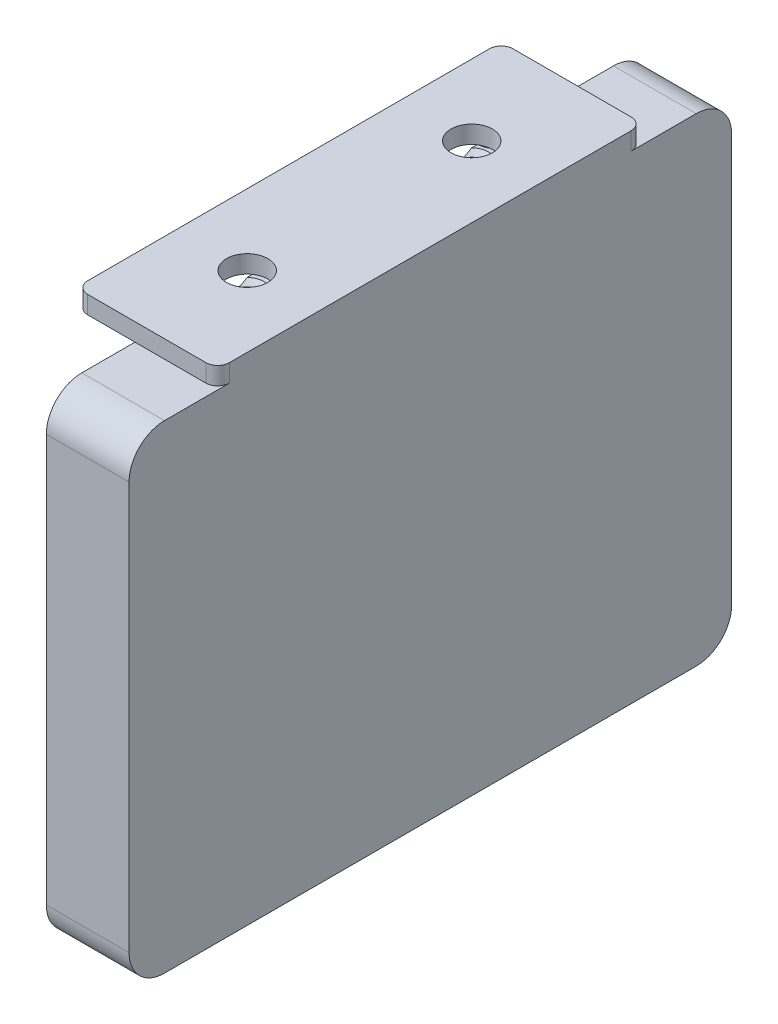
ISO-10303-21;
HEADER;
FILE_DESCRIPTION(('STEP AP214'),'2;1');
FILE_NAME('part.step','',(''),(''),'','','');
FILE_SCHEMA(('AUTOMOTIVE_DESIGN { 1 0 10303 214 1 1 1 1 }'));
ENDSEC;
DATA;
#1=APPLICATION_CONTEXT('core data for automotive mechanical design processes');
#2=APPLICATION_PROTOCOL_DEFINITION('international standard','automotive_design',2000,#1);
#3=PRODUCT_CONTEXT('',#1,'mechanical');
#4=PRODUCT('Part','Part','',(#3));
#5=PRODUCT_RELATED_PRODUCT_CATEGORY('part','',(#4));
#6=PRODUCT_DEFINITION_FORMATION('','',#4);
#7=PRODUCT_DEFINITION_CONTEXT('part definition',#1,'design');
#8=PRODUCT_DEFINITION('design','',#6,#7);
#9=PRODUCT_DEFINITION_SHAPE('','',#8);
#10=(LENGTH_UNIT() NAMED_UNIT(*) SI_UNIT(.MILLI.,.METRE.));
#11=(NAMED_UNIT(*) PLANE_ANGLE_UNIT() SI_UNIT($,.RADIAN.));
#12=(NAMED_UNIT(*) SI_UNIT($,.STERADIAN.) SOLID_ANGLE_UNIT());
#13=UNCERTAINTY_MEASURE_WITH_UNIT(LENGTH_MEASURE(1.E-05),#10,'distance_accuracy_value','');
#14=(GEOMETRIC_REPRESENTATION_CONTEXT(3) GLOBAL_UNCERTAINTY_ASSIGNED_CONTEXT((#13)) GLOBAL_UNIT_ASSIGNED_CONTEXT((#10,
#11,#12)) REPRESENTATION_CONTEXT('',''));
#15=CARTESIAN_POINT('',(0.,0.,0.));
#16=DIRECTION('',(0.,0.,1.));
#17=DIRECTION('',(1.,0.,0.));
#18=AXIS2_PLACEMENT_3D('',#15,#16,#17);
#19=CARTESIAN_POINT('',(-71.3344870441,30.5,9.5));
#20=DIRECTION('',(0.,1.,0.));
#21=DIRECTION('',(0.,0.,1.));
#22=AXIS2_PLACEMENT_3D('',#19,#20,#21);
#23=PLANE('',#22);
#24=CARTESIAN_POINT('',(-71.3344870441,30.5,9.5));
#25=DIRECTION('',(0.,1.,0.));
#26=DIRECTION('',(0.,0.,1.));
#27=AXIS2_PLACEMENT_3D('',#24,#25,#26);
#28=CIRCLE('',#27,1.);
#29=CARTESIAN_POINT('',(-71.3344870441,30.5,10.5));
#30=VERTEX_POINT('',#29);
#31=EDGE_CURVE('E19',#30,#30,#28,.T.);
#32=ORIENTED_EDGE('',*,*,#31,.T.);
#33=EDGE_LOOP('',(#32));
#34=FACE_BOUND('',#33,.T.);
#35=ADVANCED_FACE('F16',(#34),#23,.T.);
#36=CARTESIAN_POINT('',(-71.3344870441,30.308,9.5));
#37=DIRECTION('',(0.,1.,0.));
#38=DIRECTION('',(0.,0.,1.));
#39=AXIS2_PLACEMENT_3D('',#36,#37,#38);
#40=CYLINDRICAL_SURFACE('',#39,1.);
#41=CARTESIAN_POINT('',(-71.3344870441,40.1000000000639,9.5));
#42=DIRECTION('',(0.,1.,0.));
#43=DIRECTION('',(0.,0.,1.));
#44=AXIS2_PLACEMENT_3D('',#41,#42,#43);
#45=CIRCLE('',#44,0.999999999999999);
#46=CARTESIAN_POINT('',(-71.3344870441,40.1000000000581,10.4999999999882));
#47=VERTEX_POINT('',#46);
#48=CARTESIAN_POINT('',(-72.3344870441,40.1000000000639,9.50000000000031));
#49=VERTEX_POINT('',#48);
#50=EDGE_CURVE('E765',#47,#49,#45,.F.);
#51=ORIENTED_EDGE('',*,*,#50,.F.);
#52=CARTESIAN_POINT('',(-71.3344870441,40.1000000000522,9.5));
#53=DIRECTION('',(0.,1.,0.));
#54=DIRECTION('',(0.,0.,1.));
#55=AXIS2_PLACEMENT_3D('',#52,#53,#54);
#56=CIRCLE('',#55,1.);
#57=EDGE_CURVE('E413',#47,#49,#56,.T.);
#58=ORIENTED_EDGE('',*,*,#57,.T.);
#59=EDGE_LOOP('',(#51,#58));
#60=FACE_BOUND('',#59,.T.);
#61=ORIENTED_EDGE('',*,*,#31,.F.);
#62=EDGE_LOOP('',(#61));
#63=FACE_BOUND('',#62,.T.);
#64=ADVANCED_FACE('F1056',(#60,#63),#40,.F.);
#65=CARTESIAN_POINT('',(-72.3344870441,19.5,0.));
#66=DIRECTION('',(1.,0.,0.));
#67=DIRECTION('',(0.,0.,-1.));
#68=AXIS2_PLACEMENT_3D('',#65,#66,#67);
#69=PLANE('',#68);
#70=DIRECTION('',(0.,1.,0.));
#71=VECTOR('',#70,1.);
#72=CARTESIAN_POINT('',(-72.3344870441,19.5,-12.));
#73=LINE('',#72,#71);
#74=CARTESIAN_POINT('',(-72.3344870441,5.49999999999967,-11.9999999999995));
#75=VERTEX_POINT('',#74);
#76=CARTESIAN_POINT('',(-72.3344870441,2.49999999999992,-11.9999999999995));
#77=VERTEX_POINT('',#76);
#78=EDGE_CURVE('E571',#75,#77,#73,.F.);
#79=ORIENTED_EDGE('',*,*,#78,.F.);
#80=DIRECTION('',(0.,0.707106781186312,-0.707106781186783));
#81=VECTOR('',#80,1.);
#82=CARTESIAN_POINT('',(-72.3344870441,4.,-10.5));
#83=LINE('',#82,#81);
#84=CARTESIAN_POINT('',(-72.3344870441,3.99999999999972,-10.5000000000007));
#85=VERTEX_POINT('',#84);
#86=EDGE_CURVE('E667',#85,#75,#83,.T.);
#87=ORIENTED_EDGE('',*,*,#86,.F.);
#88=DIRECTION('',(0.,0.707106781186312,0.707106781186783));
#89=VECTOR('',#88,1.);
#90=CARTESIAN_POINT('',(-72.3344870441,2.500000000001,-12.));
#91=LINE('',#90,#89);
#92=EDGE_CURVE('E541',#77,#85,#91,.T.);
#93=ORIENTED_EDGE('',*,*,#92,.F.);
#94=EDGE_LOOP('',(#79,#87,#93));
#95=FACE_BOUND('',#94,.T.);
#96=DIRECTION('',(0.,1.,0.));
#97=VECTOR('',#96,1.);
#98=CARTESIAN_POINT('',(-72.3344870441,6.75,-12.));
#99=LINE('',#98,#97);
#100=CARTESIAN_POINT('',(-72.3344870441,7.,-12.));
#101=VERTEX_POINT('',#100);
#102=CARTESIAN_POINT('',(-72.3344870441,6.49999999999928,-11.9999999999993));
#103=VERTEX_POINT('',#102);
#104=EDGE_CURVE('E600',#101,#103,#99,.F.);
#105=ORIENTED_EDGE('',*,*,#104,.F.);
#106=DIRECTION('',(0.,0.,-1.));
#107=VECTOR('',#106,1.);
#108=CARTESIAN_POINT('',(-72.3344870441,7.,0.));
#109=LINE('',#108,#107);
#110=CARTESIAN_POINT('',(-72.3344870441,7.00000000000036,-11.5000000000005));
#111=VERTEX_POINT('',#110);
#112=EDGE_CURVE('E583',#111,#101,#109,.T.);
#113=ORIENTED_EDGE('',*,*,#112,.F.);
#114=DIRECTION('',(0.,-0.707106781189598,-0.707106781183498));
#115=VECTOR('',#114,1.);
#116=CARTESIAN_POINT('',(-72.3344870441,6.75,-11.75));
#117=LINE('',#116,#115);
#118=EDGE_CURVE('E660',#111,#103,#117,.T.);
#119=ORIENTED_EDGE('',*,*,#118,.T.);
#120=EDGE_LOOP('',(#105,#113,#119));
#121=FACE_BOUND('',#120,.T.);
#122=DIRECTION('',(0.,0.,-1.));
#123=VECTOR('',#122,1.);
#124=CARTESIAN_POINT('',(-72.3344870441,40.5,0.));
#125=LINE('',#124,#123);
#126=CARTESIAN_POINT('',(-72.3344870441,40.5,14.));
#127=VERTEX_POINT('',#126);
#128=CARTESIAN_POINT('',(-72.3344870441,40.5,18.));
#129=VERTEX_POINT('',#128);
#130=EDGE_CURVE('E395',#127,#129,#125,.F.);
#131=ORIENTED_EDGE('',*,*,#130,.F.);
#132=DIRECTION('',(0.,1.,0.));
#133=VECTOR('',#132,1.);
#134=CARTESIAN_POINT('',(-72.3344870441,39.36727663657,14.));
#135=LINE('',#134,#133);
#136=CARTESIAN_POINT('',(-72.3344870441,39.5,14.));
#137=VERTEX_POINT('',#136);
#138=EDGE_CURVE('E394',#127,#137,#135,.F.);
#139=ORIENTED_EDGE('',*,*,#138,.T.);
#140=DIRECTION('',(0.,0.,-1.));
#141=VECTOR('',#140,1.);
#142=CARTESIAN_POINT('',(-72.3344870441,39.5,0.));
#143=LINE('',#142,#141);
#144=CARTESIAN_POINT('',(-72.3344870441,39.5,11.));
#145=VERTEX_POINT('',#144);
#146=EDGE_CURVE('E754',#145,#137,#143,.F.);
#147=ORIENTED_EDGE('',*,*,#146,.F.);
#148=DIRECTION('',(0.,1.,0.));
#149=VECTOR('',#148,1.);
#150=CARTESIAN_POINT('',(-72.3344870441,39.36727663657,11.));
#151=LINE('',#150,#149);
#152=CARTESIAN_POINT('',(-72.3344870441,40.5,11.));
#153=VERTEX_POINT('',#152);
#154=EDGE_CURVE('E750',#145,#153,#151,.T.);
#155=ORIENTED_EDGE('',*,*,#154,.T.);
#156=DIRECTION('',(0.,0.,-1.));
#157=VECTOR('',#156,1.);
#158=CARTESIAN_POINT('',(-72.3344870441,40.5,0.));
#159=LINE('',#158,#157);
#160=CARTESIAN_POINT('',(-72.3344870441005,40.5,10.936140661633));
#161=VERTEX_POINT('',#160);
#162=EDGE_CURVE('E760',#161,#153,#159,.F.);
#163=ORIENTED_EDGE('',*,*,#162,.F.);
#164=DIRECTION('',(0.,0.,1.));
#165=VECTOR('',#164,1.);
#166=CARTESIAN_POINT('',(-72.3344870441,40.5,9.5));
#167=LINE('',#166,#165);
#168=CARTESIAN_POINT('',(-72.3344870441,40.5000000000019,10.4797958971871));
#169=VERTEX_POINT('',#168);
#170=EDGE_CURVE('E415',#169,#161,#167,.T.);
#171=ORIENTED_EDGE('',*,*,#170,.F.);
#172=CARTESIAN_POINT('',(-72.3344870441,40.1000000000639,9.50000000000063));
#173=CARTESIAN_POINT('',(-72.3344870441,40.0999742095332,9.53076092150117));
#174=CARTESIAN_POINT('',(-72.3344870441,40.1014187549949,9.56150590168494));
#175=CARTESIAN_POINT('',(-72.3344870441,40.1070450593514,9.62268679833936));
#176=CARTESIAN_POINT('',(-72.3344870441,40.1112214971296,9.65312319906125));
#177=CARTESIAN_POINT('',(-72.3344870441,40.1220148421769,9.71300534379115));
#178=CARTESIAN_POINT('',(-72.3344870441,40.1285880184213,9.74245911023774));
#179=CARTESIAN_POINT('',(-72.3344870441,40.143882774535,9.80080435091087));
#180=CARTESIAN_POINT('',(-72.3344870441,40.1526050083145,9.82969565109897));
#181=CARTESIAN_POINT('',(-72.3344870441,40.1807911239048,9.91327218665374));
#182=CARTESIAN_POINT('',(-72.3344870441,40.2027330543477,9.96712226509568));
#183=CARTESIAN_POINT('',(-72.3344870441,40.2514179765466,10.0726839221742));
#184=CARTESIAN_POINT('',(-72.3344870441,40.278172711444,10.1243898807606));
#185=CARTESIAN_POINT('',(-72.3344870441,40.3360565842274,10.2278325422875));
#186=CARTESIAN_POINT('',(-72.3344870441,40.3673121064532,10.2794977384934));
#187=CARTESIAN_POINT('',(-72.3344870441,40.415953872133,10.3556341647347));
#188=CARTESIAN_POINT('',(-72.3344870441,40.4324084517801,10.3807122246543));
#189=CARTESIAN_POINT('',(-72.3344870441,40.4658361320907,10.4305094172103));
#190=CARTESIAN_POINT('',(-72.3344870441,40.4828090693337,10.455228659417));
#191=CARTESIAN_POINT('',(-72.3344870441,40.4999999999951,10.4797958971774));
#192=B_SPLINE_CURVE_WITH_KNOTS('',3,(#172,#173,#174,#175,#176,#177,#178,#179,#180,#181,#182,
#183,#184,#185,#186,#187,#188,#189,#190,#191),.UNSPECIFIED.,.F.,.F.,(4,2,2,2,2,2,2,2,2,4),(0.,
0.0922233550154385,0.184267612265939,0.274710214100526,0.365180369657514,0.539251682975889,
0.713753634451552,0.894797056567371,0.984775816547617,1.07472649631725),.UNSPECIFIED.);
#193=EDGE_CURVE('E772',#49,#169,#192,.T.);
#194=ORIENTED_EDGE('',*,*,#193,.F.);
#195=CARTESIAN_POINT('',(-72.3344870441,40.1000000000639,9.50000000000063));
#196=CARTESIAN_POINT('',(-72.3344870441,40.0999742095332,9.46923907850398));
#197=CARTESIAN_POINT('',(-72.3344870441,40.1014187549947,9.43849409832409));
#198=CARTESIAN_POINT('',(-72.3344870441,40.1070450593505,9.37731320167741));
#199=CARTESIAN_POINT('',(-72.3344870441,40.1112214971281,9.34687680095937));
#200=CARTESIAN_POINT('',(-72.3344870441,40.1220148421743,9.28699465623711));
#201=CARTESIAN_POINT('',(-72.3344870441,40.1285880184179,9.25754088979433));
#202=CARTESIAN_POINT('',(-72.3344870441,40.1438827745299,9.19919564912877));
#203=CARTESIAN_POINT('',(-72.3344870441,40.1526050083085,9.17030434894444));
#204=CARTESIAN_POINT('',(-72.3344870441,40.1807911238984,9.08672781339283));
#205=CARTESIAN_POINT('',(-72.3344870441,40.2027330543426,9.03287773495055));
#206=CARTESIAN_POINT('',(-72.3344870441,40.2514179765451,8.92731607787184));
#207=CARTESIAN_POINT('',(-72.3344870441,40.2781727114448,8.87561011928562));
#208=CARTESIAN_POINT('',(-72.3344870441,40.3360565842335,8.7721674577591));
#209=CARTESIAN_POINT('',(-72.3344870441,40.3673121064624,8.72050226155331));
#210=CARTESIAN_POINT('',(-72.3344870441,40.4159538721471,8.6443658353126));
#211=CARTESIAN_POINT('',(-72.3344870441,40.4324084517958,8.6192877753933));
#212=CARTESIAN_POINT('',(-72.3344870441,40.4658361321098,8.56949058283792));
#213=CARTESIAN_POINT('',(-72.3344870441,40.4828090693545,8.54477134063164));
#214=CARTESIAN_POINT('',(-72.3344870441,40.5000000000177,8.52020410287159));
#215=B_SPLINE_CURVE_WITH_KNOTS('',3,(#195,#196,#197,#198,#199,#200,#201,#202,#203,#204,#205,
#206,#207,#208,#209,#210,#211,#212,#213,#214),.UNSPECIFIED.,.F.,.F.,(4,2,2,2,2,2,2,2,2,4),(0.,
0.0922233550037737,0.184267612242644,0.274710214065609,0.365180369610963,0.539251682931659,
0.713753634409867,0.894797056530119,0.984775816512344,1.07472649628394),.UNSPECIFIED.);
#216=CARTESIAN_POINT('',(-72.3344870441,40.5000000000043,8.52020410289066));
#217=VERTEX_POINT('',#216);
#218=EDGE_CURVE('E410',#49,#217,#215,.T.);
#219=ORIENTED_EDGE('',*,*,#218,.T.);
#220=DIRECTION('',(0.,0.,1.));
#221=VECTOR('',#220,1.);
#222=CARTESIAN_POINT('',(-72.3344870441,40.5,9.5));
#223=LINE('',#222,#221);
#224=CARTESIAN_POINT('',(-72.3344870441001,40.5,8.06385933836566));
#225=VERTEX_POINT('',#224);
#226=EDGE_CURVE('E405',#225,#217,#223,.T.);
#227=ORIENTED_EDGE('',*,*,#226,.F.);
#228=DIRECTION('',(0.,0.,-1.));
#229=VECTOR('',#228,1.);
#230=CARTESIAN_POINT('',(-72.3344870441,40.5,0.));
#231=LINE('',#230,#229);
#232=CARTESIAN_POINT('',(-72.3344870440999,40.5,-8.06385933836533));
#233=VERTEX_POINT('',#232);
#234=EDGE_CURVE('E774',#233,#225,#231,.F.);
#235=ORIENTED_EDGE('',*,*,#234,.F.);
#236=DIRECTION('',(0.,0.,1.));
#237=VECTOR('',#236,1.);
#238=CARTESIAN_POINT('',(-72.3344870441,40.5,-9.5));
#239=LINE('',#238,#237);
#240=CARTESIAN_POINT('',(-72.3344870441,40.5000000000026,-8.52020410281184));
#241=VERTEX_POINT('',#240);
#242=EDGE_CURVE('E784',#241,#233,#239,.T.);
#243=ORIENTED_EDGE('',*,*,#242,.F.);
#244=CARTESIAN_POINT('',(-72.3344870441,40.1000000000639,-9.49999999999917));
#245=CARTESIAN_POINT('',(-72.3344870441,40.0999742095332,-9.46923907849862));
#246=CARTESIAN_POINT('',(-72.3344870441,40.1014187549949,-9.43849409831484));
#247=CARTESIAN_POINT('',(-72.3344870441,40.1070450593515,-9.37731320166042));
#248=CARTESIAN_POINT('',(-72.3344870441,40.1112214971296,-9.34687680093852));
#249=CARTESIAN_POINT('',(-72.3344870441,40.122014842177,-9.28699465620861));
#250=CARTESIAN_POINT('',(-72.3344870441,40.1285880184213,-9.25754088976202));
#251=CARTESIAN_POINT('',(-72.3344870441,40.1438827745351,-9.19919564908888));
#252=CARTESIAN_POINT('',(-72.3344870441,40.1526050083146,-9.17030434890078));
#253=CARTESIAN_POINT('',(-72.3344870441,40.1807911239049,-9.08672781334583));
#254=CARTESIAN_POINT('',(-72.3344870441,40.2027330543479,-9.03287773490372));
#255=CARTESIAN_POINT('',(-72.3344870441,40.251417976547,-8.92731607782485));
#256=CARTESIAN_POINT('',(-72.3344870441,40.2781727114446,-8.8756101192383));
#257=CARTESIAN_POINT('',(-72.3344870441,40.3360565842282,-8.77216745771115));
#258=CARTESIAN_POINT('',(-72.3344870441,40.3673121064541,-8.72050226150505));
#259=CARTESIAN_POINT('',(-72.3344870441,40.4159538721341,-8.64436583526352));
#260=CARTESIAN_POINT('',(-72.3344870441,40.4324084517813,-8.61928777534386));
#261=CARTESIAN_POINT('',(-72.3344870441,40.4658361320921,-8.56949058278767));
#262=CARTESIAN_POINT('',(-72.3344870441,40.4828090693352,-8.54477134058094));
#263=CARTESIAN_POINT('',(-72.3344870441,40.4999999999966,-8.52020410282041));
#264=B_SPLINE_CURVE_WITH_KNOTS('',3,(#244,#245,#246,#247,#248,#249,#250,#251,#252,#253,#254,
#255,#256,#257,#258,#259,#260,#261,#262,#263),.UNSPECIFIED.,.F.,.F.,(4,2,2,2,2,2,2,2,2,4),(0.,
0.0922233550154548,0.18426761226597,0.274710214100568,0.36518036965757,0.539251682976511,
0.713753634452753,0.89479705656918,0.98477581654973,1.07472649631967),.UNSPECIFIED.);
#265=CARTESIAN_POINT('',(-72.3344870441,40.1000000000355,-9.49999999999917));
#266=VERTEX_POINT('',#265);
#267=EDGE_CURVE('E71',#266,#241,#264,.T.);
#268=ORIENTED_EDGE('',*,*,#267,.F.);
#269=CARTESIAN_POINT('',(-72.3344870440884,40.1000000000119,-9.49999999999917));
#270=CARTESIAN_POINT('',(-72.3344870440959,40.099974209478,-9.53076092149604));
#271=CARTESIAN_POINT('',(-72.3344870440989,40.1014187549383,-9.56150590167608));
#272=CARTESIAN_POINT('',(-72.3344870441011,40.1070450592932,-9.62268679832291));
#273=CARTESIAN_POINT('',(-72.3344870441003,40.1112214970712,-9.65312319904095));
#274=CARTESIAN_POINT('',(-72.3344870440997,40.1220148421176,-9.71300534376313));
#275=CARTESIAN_POINT('',(-72.3344870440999,40.1285880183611,-9.74245911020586));
#276=CARTESIAN_POINT('',(-72.3344870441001,40.143882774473,-9.80080435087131));
#277=CARTESIAN_POINT('',(-72.3344870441,40.1526050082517,-9.8296956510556));
#278=CARTESIAN_POINT('',(-72.3344870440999,40.1807911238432,-9.91327218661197));
#279=CARTESIAN_POINT('',(-72.3344870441,40.2027330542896,-9.96712226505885));
#280=CARTESIAN_POINT('',(-72.3344870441,40.2514179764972,-10.0726839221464));
#281=CARTESIAN_POINT('',(-72.3344870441,40.2781727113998,-10.1243898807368));
#282=CARTESIAN_POINT('',(-72.3344870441,40.3360565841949,-10.227832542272));
#283=CARTESIAN_POINT('',(-72.3344870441,40.3673121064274,-10.2794977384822));
#284=CARTESIAN_POINT('',(-72.3344870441,40.4159538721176,-10.3556341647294));
#285=CARTESIAN_POINT('',(-72.3344870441,40.4324084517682,-10.3807122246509));
#286=CARTESIAN_POINT('',(-72.3344870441,40.4658361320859,-10.4305094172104));
#287=CARTESIAN_POINT('',(-72.3344870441,40.4828090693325,-10.4552286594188));
#288=CARTESIAN_POINT('',(-72.3344870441,40.4999999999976,-10.4797958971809));
#289=B_SPLINE_CURVE_WITH_KNOTS('',3,(#269,#270,#271,#272,#273,#274,#275,#276,#277,#278,#279,
#280,#281,#282,#283,#284,#285,#286,#287,#288),.UNSPECIFIED.,.F.,.F.,(4,2,2,2,2,2,2,2,2,4),(0.,
0.0922233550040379,0.184267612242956,0.274710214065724,0.365180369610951,0.539251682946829,
0.713753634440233,0.894797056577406,0.984775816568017,1.07472649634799),.UNSPECIFIED.);
#290=CARTESIAN_POINT('',(-72.3344870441,40.5000000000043,-10.4797958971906));
#291=VERTEX_POINT('',#290);
#292=EDGE_CURVE('E755',#266,#291,#289,.T.);
#293=ORIENTED_EDGE('',*,*,#292,.T.);
#294=DIRECTION('',(0.,0.,1.));
#295=VECTOR('',#294,1.);
#296=CARTESIAN_POINT('',(-72.3344870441,40.5,-9.5));
#297=LINE('',#296,#295);
#298=CARTESIAN_POINT('',(-72.3344870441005,40.5,-10.936140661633));
#299=VERTEX_POINT('',#298);
#300=EDGE_CURVE('E778',#299,#291,#297,.T.);
#301=ORIENTED_EDGE('',*,*,#300,.F.);
#302=DIRECTION('',(0.,0.,-1.));
#303=VECTOR('',#302,1.);
#304=CARTESIAN_POINT('',(-72.3344870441,40.5,0.));
#305=LINE('',#304,#303);
#306=CARTESIAN_POINT('',(-72.3344870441,40.5,-11.));
#307=VERTEX_POINT('',#306);
#308=EDGE_CURVE('E788',#307,#299,#305,.F.);
#309=ORIENTED_EDGE('',*,*,#308,.F.);
#310=DIRECTION('',(0.,1.,0.));
#311=VECTOR('',#310,1.);
#312=CARTESIAN_POINT('',(-72.3344870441,39.36727663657,-11.));
#313=LINE('',#312,#311);
#314=CARTESIAN_POINT('',(-72.3344870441,39.5,-11.));
#315=VERTEX_POINT('',#314);
#316=EDGE_CURVE('E791',#307,#315,#313,.F.);
#317=ORIENTED_EDGE('',*,*,#316,.T.);
#318=DIRECTION('',(0.,0.,-1.));
#319=VECTOR('',#318,1.);
#320=CARTESIAN_POINT('',(-72.3344870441,39.5,0.));
#321=LINE('',#320,#319);
#322=CARTESIAN_POINT('',(-72.3344870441,39.5,-14.));
#323=VERTEX_POINT('',#322);
#324=EDGE_CURVE('E798',#323,#315,#321,.F.);
#325=ORIENTED_EDGE('',*,*,#324,.F.);
#326=DIRECTION('',(0.,1.,0.));
#327=VECTOR('',#326,1.);
#328=CARTESIAN_POINT('',(-72.3344870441,39.36727663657,-14.));
#329=LINE('',#328,#327);
#330=CARTESIAN_POINT('',(-72.3344870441,40.5,-14.));
#331=VERTEX_POINT('',#330);
#332=EDGE_CURVE('E794',#323,#331,#329,.T.);
#333=ORIENTED_EDGE('',*,*,#332,.T.);
#334=DIRECTION('',(0.,0.,-1.));
#335=VECTOR('',#334,1.);
#336=CARTESIAN_POINT('',(-72.3344870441,40.5,0.));
#337=LINE('',#336,#335);
#338=CARTESIAN_POINT('',(-72.3344870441,40.5,-18.));
#339=VERTEX_POINT('',#338);
#340=EDGE_CURVE('E349',#339,#331,#337,.F.);
#341=ORIENTED_EDGE('',*,*,#340,.F.);
#342=DIRECTION('',(0.,0.,1.));
#343=VECTOR('',#342,1.);
#344=CARTESIAN_POINT('',(-72.3344870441,40.5,-19.75));
#345=LINE('',#344,#343);
#346=CARTESIAN_POINT('',(-72.3344870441,40.5,-22.5));
#347=VERTEX_POINT('',#346);
#348=EDGE_CURVE('E358',#347,#339,#345,.T.);
#349=ORIENTED_EDGE('',*,*,#348,.F.);
#350=CARTESIAN_POINT('',(-72.3344870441,37.5,-22.5));
#351=DIRECTION('',(-1.,0.,0.));
#352=DIRECTION('',(0.,0.,1.));
#353=AXIS2_PLACEMENT_3D('',#350,#351,#352);
#354=CIRCLE('',#353,3.);
#355=CARTESIAN_POINT('',(-72.3344870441,37.5,-25.5));
#356=VERTEX_POINT('',#355);
#357=EDGE_CURVE('E470',#356,#347,#354,.F.);
#358=ORIENTED_EDGE('',*,*,#357,.F.);
#359=DIRECTION('',(0.,1.,0.));
#360=VECTOR('',#359,1.);
#361=CARTESIAN_POINT('',(-72.3344870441,20.25,-25.5));
#362=LINE('',#361,#360);
#363=CARTESIAN_POINT('',(-72.3344870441,3.,-25.5));
#364=VERTEX_POINT('',#363);
#365=EDGE_CURVE('E727',#356,#364,#362,.F.);
#366=ORIENTED_EDGE('',*,*,#365,.T.);
#367=CARTESIAN_POINT('',(-72.3344870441,3.,-22.5));
#368=DIRECTION('',(-1.,0.,0.));
#369=DIRECTION('',(0.,0.,1.));
#370=AXIS2_PLACEMENT_3D('',#367,#368,#369);
#371=CIRCLE('',#370,3.);
#372=CARTESIAN_POINT('',(-72.3344870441,0.,-22.5));
#373=VERTEX_POINT('',#372);
#374=EDGE_CURVE('E478',#373,#364,#371,.F.);
#375=ORIENTED_EDGE('',*,*,#374,.F.);
#376=DIRECTION('',(0.,0.,1.));
#377=VECTOR('',#376,1.);
#378=CARTESIAN_POINT('',(-72.3344870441,0.,0.));
#379=LINE('',#378,#377);
#380=CARTESIAN_POINT('',(-72.3344870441,0.,-12.));
#381=VERTEX_POINT('',#380);
#382=EDGE_CURVE('E687',#373,#381,#379,.T.);
#383=ORIENTED_EDGE('',*,*,#382,.T.);
#384=DIRECTION('',(0.,1.,0.));
#385=VECTOR('',#384,1.);
#386=CARTESIAN_POINT('',(-72.3344870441,0.75,-12.));
#387=LINE('',#386,#385);
#388=CARTESIAN_POINT('',(-72.3344870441,-0.999999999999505,-11.9999999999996));
#389=VERTEX_POINT('',#388);
#390=EDGE_CURVE('E563',#381,#389,#387,.F.);
#391=ORIENTED_EDGE('',*,*,#390,.T.);
#392=DIRECTION('',(0.,-0.707106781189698,0.707106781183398));
#393=VECTOR('',#392,1.);
#394=CARTESIAN_POINT('',(-72.3344870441,-1.25,-11.75));
#395=LINE('',#394,#393);
#396=CARTESIAN_POINT('',(-72.3344870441,-1.50000000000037,-11.5000000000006));
#397=VERTEX_POINT('',#396);
#398=EDGE_CURVE('E566',#389,#397,#395,.T.);
#399=ORIENTED_EDGE('',*,*,#398,.T.);
#400=DIRECTION('',(0.,0.,-1.));
#401=VECTOR('',#400,1.);
#402=CARTESIAN_POINT('',(-72.3344870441,-1.5,0.));
#403=LINE('',#402,#401);
#404=CARTESIAN_POINT('',(-72.3344870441,-1.50000000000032,11.5000000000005));
#405=VERTEX_POINT('',#404);
#406=EDGE_CURVE('E681',#405,#397,#403,.T.);
#407=ORIENTED_EDGE('',*,*,#406,.F.);
#408=DIRECTION('',(0.,-0.707106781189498,-0.707106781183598));
#409=VECTOR('',#408,1.);
#410=CARTESIAN_POINT('',(-72.3344870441,-1.25,11.75));
#411=LINE('',#410,#409);
#412=CARTESIAN_POINT('',(-72.3344870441,-0.999999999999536,11.9999999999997));
#413=VERTEX_POINT('',#412);
#414=EDGE_CURVE('E550',#413,#405,#411,.T.);
#415=ORIENTED_EDGE('',*,*,#414,.F.);
#416=DIRECTION('',(0.,1.,0.));
#417=VECTOR('',#416,1.);
#418=CARTESIAN_POINT('',(-72.3344870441,0.75,12.));
#419=LINE('',#418,#417);
#420=CARTESIAN_POINT('',(-72.3344870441,0.,12.));
#421=VERTEX_POINT('',#420);
#422=EDGE_CURVE('E545',#421,#413,#419,.F.);
#423=ORIENTED_EDGE('',*,*,#422,.F.);
#424=DIRECTION('',(0.,0.,1.));
#425=VECTOR('',#424,1.);
#426=CARTESIAN_POINT('',(-72.3344870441,0.,0.));
#427=LINE('',#426,#425);
#428=CARTESIAN_POINT('',(-72.3344870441,0.,22.5));
#429=VERTEX_POINT('',#428);
#430=EDGE_CURVE('E696',#421,#429,#427,.T.);
#431=ORIENTED_EDGE('',*,*,#430,.T.);
#432=CARTESIAN_POINT('',(-72.3344870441,3.,22.5));
#433=DIRECTION('',(-1.,0.,0.));
#434=DIRECTION('',(0.,0.,1.));
#435=AXIS2_PLACEMENT_3D('',#432,#433,#434);
#436=CIRCLE('',#435,3.);
#437=CARTESIAN_POINT('',(-72.3344870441,3.,25.5));
#438=VERTEX_POINT('',#437);
#439=EDGE_CURVE('E497',#438,#429,#436,.F.);
#440=ORIENTED_EDGE('',*,*,#439,.F.);
#441=DIRECTION('',(0.,1.,0.));
#442=VECTOR('',#441,1.);
#443=CARTESIAN_POINT('',(-72.3344870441,20.25,25.5));
#444=LINE('',#443,#442);
#445=CARTESIAN_POINT('',(-72.3344870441,37.5,25.5));
#446=VERTEX_POINT('',#445);
#447=EDGE_CURVE('E502',#446,#438,#444,.F.);
#448=ORIENTED_EDGE('',*,*,#447,.F.);
#449=CARTESIAN_POINT('',(-72.3344870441,37.5,22.5));
#450=DIRECTION('',(-1.,0.,0.));
#451=DIRECTION('',(0.,0.,1.));
#452=AXIS2_PLACEMENT_3D('',#449,#450,#451);
#453=CIRCLE('',#452,3.);
#454=CARTESIAN_POINT('',(-72.3344870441,40.5,22.5));
#455=VERTEX_POINT('',#454);
#456=EDGE_CURVE('E501',#455,#446,#453,.F.);
#457=ORIENTED_EDGE('',*,*,#456,.F.);
#458=DIRECTION('',(0.,0.,1.));
#459=VECTOR('',#458,1.);
#460=CARTESIAN_POINT('',(-72.3344870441,40.5,19.75));
#461=LINE('',#460,#459);
#462=EDGE_CURVE('E711',#129,#455,#461,.T.);
#463=ORIENTED_EDGE('',*,*,#462,.F.);
#464=EDGE_LOOP('',(#131,#139,#147,#155,#163,#171,#194,#219,#227,#235,#243,#268,#293,#301,#309,
#317,#325,#333,#341,#349,#358,#366,#375,#383,#391,#399,#407,#415,#423,#431,#440,#448,#457,#463));
#465=FACE_BOUND('',#464,.T.);
#466=DIRECTION('',(0.,1.,0.));
#467=VECTOR('',#466,1.);
#468=CARTESIAN_POINT('',(-72.3344870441,19.5,12.));
#469=LINE('',#468,#467);
#470=CARTESIAN_POINT('',(-72.3344870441,6.49999999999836,11.9999999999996));
#471=VERTEX_POINT('',#470);
#472=CARTESIAN_POINT('',(-72.3344870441,7.,12.));
#473=VERTEX_POINT('',#472);
#474=EDGE_CURVE('E650',#471,#473,#469,.T.);
#475=ORIENTED_EDGE('',*,*,#474,.F.);
#476=DIRECTION('',(0.,-0.707106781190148,0.707106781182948));
#477=VECTOR('',#476,1.);
#478=CARTESIAN_POINT('',(-72.3344870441,6.749999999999,11.75));
#479=LINE('',#478,#477);
#480=CARTESIAN_POINT('',(-72.3344870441,7.00000000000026,11.5000000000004));
#481=VERTEX_POINT('',#480);
#482=EDGE_CURVE('E607',#481,#471,#479,.T.);
#483=ORIENTED_EDGE('',*,*,#482,.F.);
#484=DIRECTION('',(0.,0.,-1.));
#485=VECTOR('',#484,1.);
#486=CARTESIAN_POINT('',(-72.3344870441,7.,0.));
#487=LINE('',#486,#485);
#488=EDGE_CURVE('E644',#473,#481,#487,.T.);
#489=ORIENTED_EDGE('',*,*,#488,.F.);
#490=EDGE_LOOP('',(#475,#483,#489));
#491=FACE_BOUND('',#490,.T.);
#492=DIRECTION('',(0.,-0.707106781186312,0.707106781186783));
#493=VECTOR('',#492,1.);
#494=CARTESIAN_POINT('',(-72.3344870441,4.,10.5));
#495=LINE('',#494,#493);
#496=CARTESIAN_POINT('',(-72.3344870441,4.00000000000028,10.5000000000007));
#497=VERTEX_POINT('',#496);
#498=CARTESIAN_POINT('',(-72.3344870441,2.49999999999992,11.9999999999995));
#499=VERTEX_POINT('',#498);
#500=EDGE_CURVE('E506',#497,#499,#495,.T.);
#501=ORIENTED_EDGE('',*,*,#500,.F.);
#502=DIRECTION('',(0.,-0.707106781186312,-0.707106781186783));
#503=VECTOR('',#502,1.);
#504=CARTESIAN_POINT('',(-72.3344870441,5.499999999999,12.));
#505=LINE('',#504,#503);
#506=CARTESIAN_POINT('',(-72.3344870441,5.49999999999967,11.9999999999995));
#507=VERTEX_POINT('',#506);
#508=EDGE_CURVE('E520',#507,#497,#505,.T.);
#509=ORIENTED_EDGE('',*,*,#508,.F.);
#510=DIRECTION('',(0.,1.,0.));
#511=VECTOR('',#510,1.);
#512=CARTESIAN_POINT('',(-72.3344870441,19.5,12.));
#513=LINE('',#512,#511);
#514=EDGE_CURVE('E523',#499,#507,#513,.T.);
#515=ORIENTED_EDGE('',*,*,#514,.F.);
#516=EDGE_LOOP('',(#501,#509,#515));
#517=FACE_BOUND('',#516,.T.);
#518=ADVANCED_FACE('F828',(#95,#121,#465,#491,#517),#69,.F.);
#519=CARTESIAN_POINT('',(-74.08440006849,40.5,0.));
#520=DIRECTION('',(0.,1.,0.));
#521=DIRECTION('',(0.,0.,1.));
#522=AXIS2_PLACEMENT_3D('',#519,#520,#521);
#523=PLANE('',#522);
#524=CARTESIAN_POINT('',(-76.3344870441,40.5,17.));
#525=DIRECTION('',(0.,-1.,0.));
#526=DIRECTION('',(0.,0.,-1.));
#527=AXIS2_PLACEMENT_3D('',#524,#525,#526);
#528=CIRCLE('',#527,1.);
#529=CARTESIAN_POINT('',(-77.3344870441,40.5,17.));
#530=VERTEX_POINT('',#529);
#531=CARTESIAN_POINT('',(-76.3344870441,40.5,18.));
#532=VERTEX_POINT('',#531);
#533=EDGE_CURVE('E83',#530,#532,#528,.F.);
#534=ORIENTED_EDGE('',*,*,#533,.F.);
#535=DIRECTION('',(0.,0.,-1.));
#536=VECTOR('',#535,1.);
#537=CARTESIAN_POINT('',(-77.3344870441,40.5,0.));
#538=LINE('',#537,#536);
#539=CARTESIAN_POINT('',(-77.3344870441,40.5,-17.));
#540=VERTEX_POINT('',#539);
#541=EDGE_CURVE('E1077',#530,#540,#538,.T.);
#542=ORIENTED_EDGE('',*,*,#541,.T.);
#543=CARTESIAN_POINT('',(-76.3344870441,40.5,-17.));
#544=DIRECTION('',(0.,-1.,0.));
#545=DIRECTION('',(0.,0.,-1.));
#546=AXIS2_PLACEMENT_3D('',#543,#544,#545);
#547=CIRCLE('',#546,1.);
#548=CARTESIAN_POINT('',(-76.3344870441,40.5,-18.));
#549=VERTEX_POINT('',#548);
#550=EDGE_CURVE('E364',#549,#540,#547,.F.);
#551=ORIENTED_EDGE('',*,*,#550,.F.);
#552=DIRECTION('',(1.,0.,0.));
#553=VECTOR('',#552,1.);
#554=CARTESIAN_POINT('',(-71.3344870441,40.5,-18.));
#555=LINE('',#554,#553);
#556=EDGE_CURVE('E739',#549,#339,#555,.T.);
#557=ORIENTED_EDGE('',*,*,#556,.T.);
#558=ORIENTED_EDGE('',*,*,#340,.T.);
#559=CARTESIAN_POINT('',(-72.3344870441,40.5,-12.5));
#560=DIRECTION('',(0.,1.,0.));
#561=DIRECTION('',(0.,0.,1.));
#562=AXIS2_PLACEMENT_3D('',#559,#560,#561);
#563=CIRCLE('',#562,1.5);
#564=CARTESIAN_POINT('',(-71.5204692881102,40.5,-11.2400892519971));
#565=VERTEX_POINT('',#564);
#566=EDGE_CURVE('E742',#565,#331,#563,.T.);
#567=ORIENTED_EDGE('',*,*,#566,.F.);
#568=CARTESIAN_POINT('',(-71.3344870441,40.5,-9.5));
#569=DIRECTION('',(0.,1.,0.));
#570=DIRECTION('',(0.,0.,1.));
#571=AXIS2_PLACEMENT_3D('',#568,#569,#570);
#572=CIRCLE('',#571,1.75);
#573=CARTESIAN_POINT('',(-72.2297548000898,40.5,-11.003660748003));
#574=VERTEX_POINT('',#573);
#575=EDGE_CURVE('E789',#565,#574,#572,.T.);
#576=ORIENTED_EDGE('',*,*,#575,.T.);
#577=CARTESIAN_POINT('',(-72.3344870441,40.5,-12.5));
#578=DIRECTION('',(0.,1.,0.));
#579=DIRECTION('',(0.,0.,1.));
#580=AXIS2_PLACEMENT_3D('',#577,#578,#579);
#581=CIRCLE('',#580,1.5);
#582=EDGE_CURVE('E785',#307,#574,#581,.T.);
#583=ORIENTED_EDGE('',*,*,#582,.F.);
#584=ORIENTED_EDGE('',*,*,#308,.T.);
#585=CARTESIAN_POINT('',(-71.3344870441,40.5,-9.5));
#586=DIRECTION('',(0.,1.,0.));
#587=DIRECTION('',(0.,0.,1.));
#588=AXIS2_PLACEMENT_3D('',#585,#586,#587);
#589=CIRCLE('',#588,1.75);
#590=EDGE_CURVE('E776',#299,#233,#589,.T.);
#591=ORIENTED_EDGE('',*,*,#590,.T.);
#592=ORIENTED_EDGE('',*,*,#234,.T.);
#593=CARTESIAN_POINT('',(-71.3344870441,40.5,9.5));
#594=DIRECTION('',(0.,1.,0.));
#595=DIRECTION('',(0.,0.,1.));
#596=AXIS2_PLACEMENT_3D('',#593,#594,#595);
#597=CIRCLE('',#596,1.75);
#598=EDGE_CURVE('E402',#225,#161,#597,.T.);
#599=ORIENTED_EDGE('',*,*,#598,.T.);
#600=ORIENTED_EDGE('',*,*,#162,.T.);
#601=CARTESIAN_POINT('',(-72.3344870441,40.5,12.5));
#602=DIRECTION('',(0.,1.,0.));
#603=DIRECTION('',(0.,0.,1.));
#604=AXIS2_PLACEMENT_3D('',#601,#602,#603);
#605=CIRCLE('',#604,1.5);
#606=CARTESIAN_POINT('',(-72.2297548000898,40.5,11.003660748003));
#607=VERTEX_POINT('',#606);
#608=EDGE_CURVE('E374',#153,#607,#605,.F.);
#609=ORIENTED_EDGE('',*,*,#608,.T.);
#610=CARTESIAN_POINT('',(-71.3344870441,40.5,9.5));
#611=DIRECTION('',(0.,1.,0.));
#612=DIRECTION('',(0.,0.,1.));
#613=AXIS2_PLACEMENT_3D('',#610,#611,#612);
#614=CIRCLE('',#613,1.75);
#615=CARTESIAN_POINT('',(-71.5204692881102,40.5,11.2400892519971));
#616=VERTEX_POINT('',#615);
#617=EDGE_CURVE('E377',#607,#616,#614,.T.);
#618=ORIENTED_EDGE('',*,*,#617,.T.);
#619=CARTESIAN_POINT('',(-72.3344870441,40.5,12.5));
#620=DIRECTION('',(0.,1.,0.));
#621=DIRECTION('',(0.,0.,1.));
#622=AXIS2_PLACEMENT_3D('',#619,#620,#621);
#623=CIRCLE('',#622,1.5);
#624=EDGE_CURVE('E380',#127,#616,#623,.T.);
#625=ORIENTED_EDGE('',*,*,#624,.F.);
#626=ORIENTED_EDGE('',*,*,#130,.T.);
#627=DIRECTION('',(1.,0.,0.));
#628=VECTOR('',#627,1.);
#629=CARTESIAN_POINT('',(-71.3344870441,40.5,18.));
#630=LINE('',#629,#628);
#631=EDGE_CURVE('E643',#532,#129,#630,.T.);
#632=ORIENTED_EDGE('',*,*,#631,.F.);
#633=EDGE_LOOP('',(#534,#542,#551,#557,#558,#567,#576,#583,#584,#591,#592,#599,#600,#609,#618,
#625,#626,#632));
#634=FACE_BOUND('',#633,.T.);
#635=ADVANCED_FACE('F379',(#634),#523,.F.);
#636=CARTESIAN_POINT('',(-71.3344870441,40.4999999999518,-9.5));
#637=DIRECTION('',(0.,1.,0.));
#638=DIRECTION('',(0.,0.,1.));
#639=AXIS2_PLACEMENT_3D('',#636,#637,#638);
#640=CONICAL_SURFACE('',#639,1.40000000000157,0.785398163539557);
#641=DIRECTION('',(0.,-0.707106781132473,-0.707106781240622));
#642=VECTOR('',#641,1.);
#643=CARTESIAN_POINT('',(-71.3344870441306,498967.765436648,498919.165512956));
#644=LINE('',#643,#642);
#645=CARTESIAN_POINT('',(-71.3344870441,40.5000000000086,-8.09999999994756));
#646=VERTEX_POINT('',#645);
#647=CARTESIAN_POINT('',(-71.3344870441,40.1000000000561,-8.4999999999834));
#648=VERTEX_POINT('',#647);
#649=EDGE_CURVE('E640',#646,#648,#644,.T.);
#650=ORIENTED_EDGE('',*,*,#649,.T.);
#651=CARTESIAN_POINT('',(-71.3344870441,40.10000000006,-9.5));
#652=DIRECTION('',(0.,1.,0.));
#653=DIRECTION('',(0.,0.,1.));
#654=AXIS2_PLACEMENT_3D('',#651,#652,#653);
#655=CIRCLE('',#654,1.);
#656=EDGE_CURVE('E639',#266,#648,#655,.T.);
#657=ORIENTED_EDGE('',*,*,#656,.F.);
#658=ORIENTED_EDGE('',*,*,#267,.T.);
#659=CARTESIAN_POINT('',(-71.3344870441,40.5000000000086,-9.5));
#660=DIRECTION('',(0.,1.,0.));
#661=DIRECTION('',(0.,0.,1.));
#662=AXIS2_PLACEMENT_3D('',#659,#660,#661);
#663=CIRCLE('',#662,1.40000000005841);
#664=EDGE_CURVE('E799',#646,#241,#663,.F.);
#665=ORIENTED_EDGE('',*,*,#664,.F.);
#666=EDGE_LOOP('',(#650,#657,#658,#665));
#667=FACE_BOUND('',#666,.T.);
#668=ADVANCED_FACE('F1019',(#667),#640,.F.);
#669=CARTESIAN_POINT('',(-71.58448958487,39.5,-12.5));
#670=DIRECTION('',(0.,1.,0.));
#671=DIRECTION('',(0.,0.,1.));
#672=AXIS2_PLACEMENT_3D('',#669,#670,#671);
#673=PLANE('',#672);
#674=CARTESIAN_POINT('',(-72.3344870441,39.5,-12.5));
#675=DIRECTION('',(0.,1.,0.));
#676=DIRECTION('',(0.,0.,1.));
#677=AXIS2_PLACEMENT_3D('',#674,#675,#676);
#678=CIRCLE('',#677,1.5);
#679=EDGE_CURVE('E795',#315,#323,#678,.T.);
#680=ORIENTED_EDGE('',*,*,#679,.T.);
#681=ORIENTED_EDGE('',*,*,#324,.T.);
#682=EDGE_LOOP('',(#680,#681));
#683=FACE_BOUND('',#682,.T.);
#684=ADVANCED_FACE('F1023',(#683),#673,.T.);
#685=CARTESIAN_POINT('',(-70.95949000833,40.5,-9.5));
#686=DIRECTION('',(0.,1.,0.));
#687=DIRECTION('',(0.,0.,1.));
#688=AXIS2_PLACEMENT_3D('',#685,#686,#687);
#689=PLANE('',#688);
#690=CARTESIAN_POINT('',(-71.3344870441,40.5,-9.5));
#691=DIRECTION('',(0.,1.,0.));
#692=DIRECTION('',(0.,0.,1.));
#693=AXIS2_PLACEMENT_3D('',#690,#691,#692);
#694=CIRCLE('',#693,1.75);
#695=EDGE_CURVE('E801',#233,#565,#694,.T.);
#696=ORIENTED_EDGE('',*,*,#695,.T.);
#697=CARTESIAN_POINT('',(-72.3344870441,40.5,-12.5));
#698=DIRECTION('',(0.,1.,0.));
#699=DIRECTION('',(0.,0.,1.));
#700=AXIS2_PLACEMENT_3D('',#697,#698,#699);
#701=CIRCLE('',#700,1.5);
#702=EDGE_CURVE('E419',#565,#574,#701,.F.);
#703=ORIENTED_EDGE('',*,*,#702,.T.);
#704=CARTESIAN_POINT('',(-71.3344870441,40.5,-9.5));
#705=DIRECTION('',(0.,1.,0.));
#706=DIRECTION('',(0.,0.,1.));
#707=AXIS2_PLACEMENT_3D('',#704,#705,#706);
#708=CIRCLE('',#707,1.75);
#709=EDGE_CURVE('E781',#574,#299,#708,.T.);
#710=ORIENTED_EDGE('',*,*,#709,.T.);
#711=ORIENTED_EDGE('',*,*,#300,.T.);
#712=CARTESIAN_POINT('',(-71.3344870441,40.5000000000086,-9.5));
#713=DIRECTION('',(0.,1.,0.));
#714=DIRECTION('',(0.,0.,1.));
#715=AXIS2_PLACEMENT_3D('',#712,#713,#714);
#716=CIRCLE('',#715,1.40000000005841);
#717=EDGE_CURVE('E780',#291,#646,#716,.F.);
#718=ORIENTED_EDGE('',*,*,#717,.T.);
#719=ORIENTED_EDGE('',*,*,#664,.T.);
#720=ORIENTED_EDGE('',*,*,#242,.T.);
#721=EDGE_LOOP('',(#696,#703,#710,#711,#718,#719,#720));
#722=FACE_BOUND('',#721,.T.);
#723=ADVANCED_FACE('F1093',(#722),#689,.T.);
#724=CARTESIAN_POINT('',(-72.3344870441,39.36727663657,-12.5));
#725=DIRECTION('',(0.,1.,0.));
#726=DIRECTION('',(0.,0.,1.));
#727=AXIS2_PLACEMENT_3D('',#724,#725,#726);
#728=CYLINDRICAL_SURFACE('',#727,1.5);
#729=ORIENTED_EDGE('',*,*,#566,.T.);
#730=ORIENTED_EDGE('',*,*,#332,.F.);
#731=ORIENTED_EDGE('',*,*,#679,.F.);
#732=ORIENTED_EDGE('',*,*,#316,.F.);
#733=ORIENTED_EDGE('',*,*,#582,.T.);
#734=ORIENTED_EDGE('',*,*,#702,.F.);
#735=EDGE_LOOP('',(#729,#730,#731,#732,#733,#734));
#736=FACE_BOUND('',#735,.T.);
#737=ADVANCED_FACE('F1040',(#736),#728,.F.);
#738=CARTESIAN_POINT('',(-71.3344870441,40.5000000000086,-9.5));
#739=DIRECTION('',(0.,1.,0.));
#740=DIRECTION('',(0.,0.,1.));
#741=AXIS2_PLACEMENT_3D('',#738,#739,#740);
#742=CONICAL_SURFACE('',#741,1.40000000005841,0.785398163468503);
#743=ORIENTED_EDGE('',*,*,#717,.F.);
#744=ORIENTED_EDGE('',*,*,#292,.F.);
#745=CARTESIAN_POINT('',(-71.3344870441,40.1000000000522,-9.5));
#746=DIRECTION('',(0.,1.,0.));
#747=DIRECTION('',(0.,0.,1.));
#748=AXIS2_PLACEMENT_3D('',#745,#746,#747);
#749=CIRCLE('',#748,1.);
#750=EDGE_CURVE('E24',#648,#266,#749,.T.);
#751=ORIENTED_EDGE('',*,*,#750,.F.);
#752=ORIENTED_EDGE('',*,*,#649,.F.);
#753=EDGE_LOOP('',(#743,#744,#751,#752));
#754=FACE_BOUND('',#753,.T.);
#755=ADVANCED_FACE('F1034',(#754),#742,.F.);
#756=CARTESIAN_POINT('',(-71.58448958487,39.5,12.5));
#757=DIRECTION('',(0.,1.,0.));
#758=DIRECTION('',(0.,0.,1.));
#759=AXIS2_PLACEMENT_3D('',#756,#757,#758);
#760=PLANE('',#759);
#761=CARTESIAN_POINT('',(-72.3344870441,39.5,12.5));
#762=DIRECTION('',(0.,1.,0.));
#763=DIRECTION('',(0.,0.,1.));
#764=AXIS2_PLACEMENT_3D('',#761,#762,#763);
#765=CIRCLE('',#764,1.5);
#766=EDGE_CURVE('E751',#137,#145,#765,.T.);
#767=ORIENTED_EDGE('',*,*,#766,.T.);
#768=ORIENTED_EDGE('',*,*,#146,.T.);
#769=EDGE_LOOP('',(#767,#768));
#770=FACE_BOUND('',#769,.T.);
#771=ADVANCED_FACE('F1039',(#770),#760,.T.);
#772=CARTESIAN_POINT('',(-71.3344870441,40.4999999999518,9.5));
#773=DIRECTION('',(0.,1.,0.));
#774=DIRECTION('',(0.,0.,1.));
#775=AXIS2_PLACEMENT_3D('',#772,#773,#774);
#776=CONICAL_SURFACE('',#775,1.40000000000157,0.785398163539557);
#777=DIRECTION('',(0.,-0.707106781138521,-0.707106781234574));
#778=VECTOR('',#777,1.);
#779=CARTESIAN_POINT('',(-71.3344870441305,498967.765445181,498938.165512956));
#780=LINE('',#779,#778);
#781=CARTESIAN_POINT('',(-71.3344870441,40.5000000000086,10.8999999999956));
#782=VERTEX_POINT('',#781);
#783=EDGE_CURVE('E757',#782,#47,#780,.T.);
#784=ORIENTED_EDGE('',*,*,#783,.T.);
#785=ORIENTED_EDGE('',*,*,#50,.T.);
#786=ORIENTED_EDGE('',*,*,#193,.T.);
#787=CARTESIAN_POINT('',(-71.3344870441,40.5000000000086,9.5));
#788=DIRECTION('',(0.,1.,0.));
#789=DIRECTION('',(0.,0.,1.));
#790=AXIS2_PLACEMENT_3D('',#787,#788,#789);
#791=CIRCLE('',#790,1.40000000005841);
#792=EDGE_CURVE('E406',#782,#169,#791,.F.);
#793=ORIENTED_EDGE('',*,*,#792,.F.);
#794=EDGE_LOOP('',(#784,#785,#786,#793));
#795=FACE_BOUND('',#794,.T.);
#796=ADVANCED_FACE('F1043',(#795),#776,.F.);
#797=CARTESIAN_POINT('',(-70.95949000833,40.5,9.5));
#798=DIRECTION('',(0.,1.,0.));
#799=DIRECTION('',(0.,0.,1.));
#800=AXIS2_PLACEMENT_3D('',#797,#798,#799);
#801=PLANE('',#800);
#802=CARTESIAN_POINT('',(-71.3344870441,40.5,9.5));
#803=DIRECTION('',(0.,1.,0.));
#804=DIRECTION('',(0.,0.,1.));
#805=AXIS2_PLACEMENT_3D('',#802,#803,#804);
#806=CIRCLE('',#805,1.75);
#807=EDGE_CURVE('E399',#616,#225,#806,.T.);
#808=ORIENTED_EDGE('',*,*,#807,.T.);
#809=ORIENTED_EDGE('',*,*,#226,.T.);
#810=CARTESIAN_POINT('',(-71.3344870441,40.5000000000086,9.5));
#811=DIRECTION('',(0.,1.,0.));
#812=DIRECTION('',(0.,0.,1.));
#813=AXIS2_PLACEMENT_3D('',#810,#811,#812);
#814=CIRCLE('',#813,1.40000000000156);
#815=EDGE_CURVE('E767',#217,#782,#814,.F.);
#816=ORIENTED_EDGE('',*,*,#815,.T.);
#817=ORIENTED_EDGE('',*,*,#792,.T.);
#818=ORIENTED_EDGE('',*,*,#170,.T.);
#819=CARTESIAN_POINT('',(-71.3344870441,40.5,9.5));
#820=DIRECTION('',(0.,1.,0.));
#821=DIRECTION('',(0.,0.,1.));
#822=AXIS2_PLACEMENT_3D('',#819,#820,#821);
#823=CIRCLE('',#822,1.75);
#824=EDGE_CURVE('E409',#161,#607,#823,.T.);
#825=ORIENTED_EDGE('',*,*,#824,.T.);
#826=CARTESIAN_POINT('',(-72.3344870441,40.5,12.5));
#827=DIRECTION('',(0.,1.,0.));
#828=DIRECTION('',(0.,0.,1.));
#829=AXIS2_PLACEMENT_3D('',#826,#827,#828);
#830=CIRCLE('',#829,1.5);
#831=EDGE_CURVE('E391',#607,#616,#830,.F.);
#832=ORIENTED_EDGE('',*,*,#831,.T.);
#833=EDGE_LOOP('',(#808,#809,#816,#817,#818,#825,#832));
#834=FACE_BOUND('',#833,.T.);
#835=ADVANCED_FACE('F408',(#834),#801,.T.);
#836=CARTESIAN_POINT('',(-71.3344870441,40.5000000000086,9.5));
#837=DIRECTION('',(0.,1.,0.));
#838=DIRECTION('',(0.,0.,1.));
#839=AXIS2_PLACEMENT_3D('',#836,#837,#838);
#840=CONICAL_SURFACE('',#839,1.40000000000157,0.785398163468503);
#841=ORIENTED_EDGE('',*,*,#815,.F.);
#842=ORIENTED_EDGE('',*,*,#218,.F.);
#843=ORIENTED_EDGE('',*,*,#57,.F.);
#844=ORIENTED_EDGE('',*,*,#783,.F.);
#845=EDGE_LOOP('',(#841,#842,#843,#844));
#846=FACE_BOUND('',#845,.T.);
#847=ADVANCED_FACE('F831',(#846),#840,.F.);
#848=CARTESIAN_POINT('',(-72.3344870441,39.36727663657,12.5));
#849=DIRECTION('',(0.,1.,0.));
#850=DIRECTION('',(0.,0.,1.));
#851=AXIS2_PLACEMENT_3D('',#848,#849,#850);
#852=CYLINDRICAL_SURFACE('',#851,1.5);
#853=ORIENTED_EDGE('',*,*,#608,.F.);
#854=ORIENTED_EDGE('',*,*,#154,.F.);
#855=ORIENTED_EDGE('',*,*,#766,.F.);
#856=ORIENTED_EDGE('',*,*,#138,.F.);
#857=ORIENTED_EDGE('',*,*,#624,.T.);
#858=ORIENTED_EDGE('',*,*,#831,.F.);
#859=EDGE_LOOP('',(#853,#854,#855,#856,#857,#858));
#860=FACE_BOUND('',#859,.T.);
#861=ADVANCED_FACE('F389',(#860),#852,.F.);
#862=CARTESIAN_POINT('',(-71.3344870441,40.36727663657,-9.5));
#863=DIRECTION('',(0.,1.,0.));
#864=DIRECTION('',(0.,0.,1.));
#865=AXIS2_PLACEMENT_3D('',#862,#863,#864);
#866=CYLINDRICAL_SURFACE('',#865,1.75);
#867=CARTESIAN_POINT('',(-71.3344870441,42.,-9.5));
#868=DIRECTION('',(0.,1.,0.));
#869=DIRECTION('',(0.,0.,1.));
#870=AXIS2_PLACEMENT_3D('',#867,#868,#869);
#871=CIRCLE('',#870,1.75);
#872=CARTESIAN_POINT('',(-71.3344870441,42.,-7.75));
#873=VERTEX_POINT('',#872);
#874=EDGE_CURVE('E420',#873,#873,#871,.F.);
#875=ORIENTED_EDGE('',*,*,#874,.F.);
#876=EDGE_LOOP('',(#875));
#877=FACE_BOUND('',#876,.T.);
#878=ORIENTED_EDGE('',*,*,#695,.F.);
#879=ORIENTED_EDGE('',*,*,#590,.F.);
#880=ORIENTED_EDGE('',*,*,#709,.F.);
#881=ORIENTED_EDGE('',*,*,#575,.F.);
#882=EDGE_LOOP('',(#878,#879,#880,#881));
#883=FACE_BOUND('',#882,.T.);
#884=ADVANCED_FACE('F839',(#877,#883),#866,.F.);
#885=CARTESIAN_POINT('',(-71.3344870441,40.36727663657,9.5));
#886=DIRECTION('',(0.,1.,0.));
#887=DIRECTION('',(0.,0.,1.));
#888=AXIS2_PLACEMENT_3D('',#885,#886,#887);
#889=CYLINDRICAL_SURFACE('',#888,1.75);
#890=CARTESIAN_POINT('',(-71.3344870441,42.,9.5));
#891=DIRECTION('',(0.,1.,0.));
#892=DIRECTION('',(0.,0.,1.));
#893=AXIS2_PLACEMENT_3D('',#890,#891,#892);
#894=CIRCLE('',#893,1.75);
#895=CARTESIAN_POINT('',(-71.3344870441,42.,11.25));
#896=VERTEX_POINT('',#895);
#897=EDGE_CURVE('E423',#896,#896,#894,.F.);
#898=ORIENTED_EDGE('',*,*,#897,.F.);
#899=EDGE_LOOP('',(#898));
#900=FACE_BOUND('',#899,.T.);
#901=ORIENTED_EDGE('',*,*,#807,.F.);
#902=ORIENTED_EDGE('',*,*,#617,.F.);
#903=ORIENTED_EDGE('',*,*,#824,.F.);
#904=ORIENTED_EDGE('',*,*,#598,.F.);
#905=EDGE_LOOP('',(#901,#902,#903,#904));
#906=FACE_BOUND('',#905,.T.);
#907=ADVANCED_FACE('F400',(#900,#906),#889,.F.);
#908=CARTESIAN_POINT('',(-76.3344870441,42.13272336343,17.));
#909=DIRECTION('',(0.,-1.,0.));
#910=DIRECTION('',(0.,0.,-1.));
#911=AXIS2_PLACEMENT_3D('',#908,#909,#910);
#912=CYLINDRICAL_SURFACE('',#911,1.);
#913=DIRECTION('',(0.,-1.,0.));
#914=VECTOR('',#913,1.);
#915=CARTESIAN_POINT('',(-77.3344870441,42.13272336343,17.));
#916=LINE('',#915,#914);
#917=CARTESIAN_POINT('',(-77.3344870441,42.,17.));
#918=VERTEX_POINT('',#917);
#919=EDGE_CURVE('E426',#918,#530,#916,.T.);
#920=ORIENTED_EDGE('',*,*,#919,.T.);
#921=ORIENTED_EDGE('',*,*,#533,.T.);
#922=DIRECTION('',(0.,1.,0.));
#923=VECTOR('',#922,1.);
#924=CARTESIAN_POINT('',(-76.3344870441,41.25,18.));
#925=LINE('',#924,#923);
#926=CARTESIAN_POINT('',(-76.3344870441,42.,18.));
#927=VERTEX_POINT('',#926);
#928=EDGE_CURVE('E428',#927,#532,#925,.F.);
#929=ORIENTED_EDGE('',*,*,#928,.F.);
#930=CARTESIAN_POINT('',(-76.3344870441,42.,17.));
#931=DIRECTION('',(0.,-1.,0.));
#932=DIRECTION('',(0.,0.,-1.));
#933=AXIS2_PLACEMENT_3D('',#930,#931,#932);
#934=CIRCLE('',#933,1.);
#935=EDGE_CURVE('E431',#918,#927,#934,.F.);
#936=ORIENTED_EDGE('',*,*,#935,.F.);
#937=EDGE_LOOP('',(#920,#921,#929,#936));
#938=FACE_BOUND('',#937,.T.);
#939=ADVANCED_FACE('F845',(#938),#912,.T.);
#940=CARTESIAN_POINT('',(-77.3344870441,41.25,0.));
#941=DIRECTION('',(1.,0.,0.));
#942=DIRECTION('',(0.,0.,-1.));
#943=AXIS2_PLACEMENT_3D('',#940,#941,#942);
#944=PLANE('',#943);
#945=ORIENTED_EDGE('',*,*,#919,.F.);
#946=DIRECTION('',(0.,0.,1.));
#947=VECTOR('',#946,1.);
#948=CARTESIAN_POINT('',(-77.3344870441,42.,0.));
#949=LINE('',#948,#947);
#950=CARTESIAN_POINT('',(-77.3344870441,42.,-17.));
#951=VERTEX_POINT('',#950);
#952=EDGE_CURVE('E434',#951,#918,#949,.T.);
#953=ORIENTED_EDGE('',*,*,#952,.F.);
#954=DIRECTION('',(0.,1.,0.));
#955=VECTOR('',#954,1.);
#956=CARTESIAN_POINT('',(-77.3344870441,41.25,-17.));
#957=LINE('',#956,#955);
#958=EDGE_CURVE('E437',#540,#951,#957,.T.);
#959=ORIENTED_EDGE('',*,*,#958,.F.);
#960=ORIENTED_EDGE('',*,*,#541,.F.);
#961=EDGE_LOOP('',(#945,#953,#959,#960));
#962=FACE_BOUND('',#961,.T.);
#963=ADVANCED_FACE('F849',(#962),#944,.F.);
#964=CARTESIAN_POINT('',(-76.3344870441,42.13272336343,-17.));
#965=DIRECTION('',(0.,-1.,0.));
#966=DIRECTION('',(0.,0.,-1.));
#967=AXIS2_PLACEMENT_3D('',#964,#965,#966);
#968=CYLINDRICAL_SURFACE('',#967,1.);
#969=DIRECTION('',(0.,-1.,0.));
#970=VECTOR('',#969,1.);
#971=CARTESIAN_POINT('',(-76.3344870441,42.13272336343,-18.));
#972=LINE('',#971,#970);
#973=CARTESIAN_POINT('',(-76.3344870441,42.,-18.));
#974=VERTEX_POINT('',#973);
#975=EDGE_CURVE('E440',#974,#549,#972,.T.);
#976=ORIENTED_EDGE('',*,*,#975,.T.);
#977=ORIENTED_EDGE('',*,*,#550,.T.);
#978=ORIENTED_EDGE('',*,*,#958,.T.);
#979=CARTESIAN_POINT('',(-76.3344870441,42.,-17.));
#980=DIRECTION('',(0.,-1.,0.));
#981=DIRECTION('',(0.,0.,-1.));
#982=AXIS2_PLACEMENT_3D('',#979,#980,#981);
#983=CIRCLE('',#982,1.);
#984=EDGE_CURVE('E443',#974,#951,#983,.F.);
#985=ORIENTED_EDGE('',*,*,#984,.F.);
#986=EDGE_LOOP('',(#976,#977,#978,#985));
#987=FACE_BOUND('',#986,.T.);
#988=ADVANCED_FACE('F852',(#987),#968,.T.);
#989=CARTESIAN_POINT('',(-71.3344870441,41.25,-18.));
#990=DIRECTION('',(0.,0.,1.));
#991=DIRECTION('',(1.,0.,0.));
#992=AXIS2_PLACEMENT_3D('',#989,#990,#991);
#993=PLANE('',#992);
#994=ORIENTED_EDGE('',*,*,#975,.F.);
#995=DIRECTION('',(1.,0.,0.));
#996=VECTOR('',#995,1.);
#997=CARTESIAN_POINT('',(-71.3344870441,42.,-18.));
#998=LINE('',#997,#996);
#999=CARTESIAN_POINT('',(-66.3344870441,42.,-18.));
#1000=VERTEX_POINT('',#999);
#1001=EDGE_CURVE('E446',#1000,#974,#998,.F.);
#1002=ORIENTED_EDGE('',*,*,#1001,.F.);
#1003=DIRECTION('',(0.,-1.,0.));
#1004=VECTOR('',#1003,1.);
#1005=CARTESIAN_POINT('',(-66.3344870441,42.13272336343,-18.));
#1006=LINE('',#1005,#1004);
#1007=CARTESIAN_POINT('',(-66.3344870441,40.5,-18.));
#1008=VERTEX_POINT('',#1007);
#1009=EDGE_CURVE('E449',#1008,#1000,#1006,.F.);
#1010=ORIENTED_EDGE('',*,*,#1009,.F.);
#1011=DIRECTION('',(1.,0.,0.));
#1012=VECTOR('',#1011,1.);
#1013=CARTESIAN_POINT('',(-68.8344870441,40.5,-18.));
#1014=LINE('',#1013,#1012);
#1015=EDGE_CURVE('E452',#339,#1008,#1014,.T.);
#1016=ORIENTED_EDGE('',*,*,#1015,.F.);
#1017=ORIENTED_EDGE('',*,*,#556,.F.);
#1018=EDGE_LOOP('',(#994,#1002,#1010,#1016,#1017));
#1019=FACE_BOUND('',#1018,.T.);
#1020=ADVANCED_FACE('F856',(#1019),#993,.F.);
#1021=CARTESIAN_POINT('',(-68.8344870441,40.5,19.75));
#1022=DIRECTION('',(0.,1.,0.));
#1023=DIRECTION('',(0.,0.,1.));
#1024=AXIS2_PLACEMENT_3D('',#1021,#1022,#1023);
#1025=PLANE('',#1024);
#1026=DIRECTION('',(0.,0.,-1.));
#1027=VECTOR('',#1026,1.);
#1028=CARTESIAN_POINT('',(-65.3344870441,40.5,0.));
#1029=LINE('',#1028,#1027);
#1030=CARTESIAN_POINT('',(-65.3344870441,40.5,17.));
#1031=VERTEX_POINT('',#1030);
#1032=CARTESIAN_POINT('',(-65.3344870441,40.5,22.5));
#1033=VERTEX_POINT('',#1032);
#1034=EDGE_CURVE('E453',#1031,#1033,#1029,.F.);
#1035=ORIENTED_EDGE('',*,*,#1034,.F.);
#1036=CARTESIAN_POINT('',(-66.3344870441,40.5,17.));
#1037=DIRECTION('',(0.,-1.,0.));
#1038=DIRECTION('',(0.,0.,-1.));
#1039=AXIS2_PLACEMENT_3D('',#1036,#1037,#1038);
#1040=CIRCLE('',#1039,1.);
#1041=CARTESIAN_POINT('',(-66.3344870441,40.5,18.));
#1042=VERTEX_POINT('',#1041);
#1043=EDGE_CURVE('E455',#1031,#1042,#1040,.T.);
#1044=ORIENTED_EDGE('',*,*,#1043,.T.);
#1045=DIRECTION('',(1.,0.,0.));
#1046=VECTOR('',#1045,1.);
#1047=CARTESIAN_POINT('',(-68.8344870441,40.5,18.));
#1048=LINE('',#1047,#1046);
#1049=EDGE_CURVE('E457',#1042,#129,#1048,.F.);
#1050=ORIENTED_EDGE('',*,*,#1049,.T.);
#1051=ORIENTED_EDGE('',*,*,#462,.T.);
#1052=DIRECTION('',(1.,0.,0.));
#1053=VECTOR('',#1052,1.);
#1054=CARTESIAN_POINT('',(-68.8344870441,40.5,22.5));
#1055=LINE('',#1054,#1053);
#1056=EDGE_CURVE('E462',#455,#1033,#1055,.T.);
#1057=ORIENTED_EDGE('',*,*,#1056,.T.);
#1058=EDGE_LOOP('',(#1035,#1044,#1050,#1051,#1057));
#1059=FACE_BOUND('',#1058,.T.);
#1060=ADVANCED_FACE('F860',(#1059),#1025,.T.);
#1061=CARTESIAN_POINT('',(-68.8344870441,40.5,-19.75));
#1062=DIRECTION('',(0.,1.,0.));
#1063=DIRECTION('',(0.,0.,1.));
#1064=AXIS2_PLACEMENT_3D('',#1061,#1062,#1063);
#1065=PLANE('',#1064);
#1066=ORIENTED_EDGE('',*,*,#1015,.T.);
#1067=CARTESIAN_POINT('',(-66.3344870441,40.5,-17.));
#1068=DIRECTION('',(0.,-1.,0.));
#1069=DIRECTION('',(0.,0.,-1.));
#1070=AXIS2_PLACEMENT_3D('',#1067,#1068,#1069);
#1071=CIRCLE('',#1070,1.);
#1072=CARTESIAN_POINT('',(-65.3344870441,40.5,-17.));
#1073=VERTEX_POINT('',#1072);
#1074=EDGE_CURVE('E458',#1073,#1008,#1071,.F.);
#1075=ORIENTED_EDGE('',*,*,#1074,.F.);
#1076=DIRECTION('',(0.,0.,-1.));
#1077=VECTOR('',#1076,1.);
#1078=CARTESIAN_POINT('',(-65.3344870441,40.5,0.));
#1079=LINE('',#1078,#1077);
#1080=CARTESIAN_POINT('',(-65.3344870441,40.5,-22.5));
#1081=VERTEX_POINT('',#1080);
#1082=EDGE_CURVE('E461',#1081,#1073,#1079,.F.);
#1083=ORIENTED_EDGE('',*,*,#1082,.F.);
#1084=DIRECTION('',(1.,0.,0.));
#1085=VECTOR('',#1084,1.);
#1086=CARTESIAN_POINT('',(-68.8344870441,40.5,-22.5));
#1087=LINE('',#1086,#1085);
#1088=EDGE_CURVE('E465',#1081,#347,#1087,.F.);
#1089=ORIENTED_EDGE('',*,*,#1088,.T.);
#1090=ORIENTED_EDGE('',*,*,#348,.T.);
#1091=EDGE_LOOP('',(#1066,#1075,#1083,#1089,#1090));
#1092=FACE_BOUND('',#1091,.T.);
#1093=ADVANCED_FACE('F864',(#1092),#1065,.T.);
#1094=CARTESIAN_POINT('',(-65.1944870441,37.5,-22.5));
#1095=DIRECTION('',(-1.,0.,0.));
#1096=DIRECTION('',(0.,0.,1.));
#1097=AXIS2_PLACEMENT_3D('',#1094,#1095,#1096);
#1098=CYLINDRICAL_SURFACE('',#1097,3.);
#1099=DIRECTION('',(-1.,0.,0.));
#1100=VECTOR('',#1099,1.);
#1101=CARTESIAN_POINT('',(-65.1944870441,37.5,-25.5));
#1102=LINE('',#1101,#1100);
#1103=CARTESIAN_POINT('',(-65.3344870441,37.5,-25.5));
#1104=VERTEX_POINT('',#1103);
#1105=EDGE_CURVE('E733',#1104,#356,#1102,.T.);
#1106=ORIENTED_EDGE('',*,*,#1105,.T.);
#1107=ORIENTED_EDGE('',*,*,#357,.T.);
#1108=ORIENTED_EDGE('',*,*,#1088,.F.);
#1109=CARTESIAN_POINT('',(-65.3344870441,37.5,-22.5));
#1110=DIRECTION('',(-1.,0.,0.));
#1111=DIRECTION('',(0.,0.,1.));
#1112=AXIS2_PLACEMENT_3D('',#1109,#1110,#1111);
#1113=CIRCLE('',#1112,3.);
#1114=EDGE_CURVE('E466',#1104,#1081,#1113,.F.);
#1115=ORIENTED_EDGE('',*,*,#1114,.F.);
#1116=EDGE_LOOP('',(#1106,#1107,#1108,#1115));
#1117=FACE_BOUND('',#1116,.T.);
#1118=ADVANCED_FACE('F868',(#1117),#1098,.T.);
#1119=CARTESIAN_POINT('',(-68.8344870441,20.25,-25.5));
#1120=DIRECTION('',(0.,0.,1.));
#1121=DIRECTION('',(1.,0.,0.));
#1122=AXIS2_PLACEMENT_3D('',#1119,#1120,#1121);
#1123=PLANE('',#1122);
#1124=DIRECTION('',(0.,1.,0.));
#1125=VECTOR('',#1124,1.);
#1126=CARTESIAN_POINT('',(-65.3344870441,21.,-25.5));
#1127=LINE('',#1126,#1125);
#1128=CARTESIAN_POINT('',(-65.3344870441,3.,-25.5));
#1129=VERTEX_POINT('',#1128);
#1130=EDGE_CURVE('E469',#1129,#1104,#1127,.T.);
#1131=ORIENTED_EDGE('',*,*,#1130,.F.);
#1132=DIRECTION('',(1.,0.,0.));
#1133=VECTOR('',#1132,1.);
#1134=CARTESIAN_POINT('',(-68.8344870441,3.,-25.5));
#1135=LINE('',#1134,#1133);
#1136=EDGE_CURVE('E473',#364,#1129,#1135,.T.);
#1137=ORIENTED_EDGE('',*,*,#1136,.F.);
#1138=ORIENTED_EDGE('',*,*,#365,.F.);
#1139=ORIENTED_EDGE('',*,*,#1105,.F.);
#1140=EDGE_LOOP('',(#1131,#1137,#1138,#1139));
#1141=FACE_BOUND('',#1140,.T.);
#1142=ADVANCED_FACE('F871',(#1141),#1123,.F.);
#1143=CARTESIAN_POINT('',(-65.1944870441,3.,-22.5));
#1144=DIRECTION('',(-1.,0.,0.));
#1145=DIRECTION('',(0.,0.,1.));
#1146=AXIS2_PLACEMENT_3D('',#1143,#1144,#1145);
#1147=CYLINDRICAL_SURFACE('',#1146,3.);
#1148=DIRECTION('',(-1.,0.,0.));
#1149=VECTOR('',#1148,1.);
#1150=CARTESIAN_POINT('',(-65.1944870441,0.,-22.5));
#1151=LINE('',#1150,#1149);
#1152=CARTESIAN_POINT('',(-65.3344870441,0.,-22.5));
#1153=VERTEX_POINT('',#1152);
#1154=EDGE_CURVE('E724',#1153,#373,#1151,.T.);
#1155=ORIENTED_EDGE('',*,*,#1154,.T.);
#1156=ORIENTED_EDGE('',*,*,#374,.T.);
#1157=ORIENTED_EDGE('',*,*,#1136,.T.);
#1158=CARTESIAN_POINT('',(-65.3344870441,3.,-22.5));
#1159=DIRECTION('',(-1.,0.,0.));
#1160=DIRECTION('',(0.,0.,1.));
#1161=AXIS2_PLACEMENT_3D('',#1158,#1159,#1160);
#1162=CIRCLE('',#1161,3.);
#1163=EDGE_CURVE('E474',#1153,#1129,#1162,.F.);
#1164=ORIENTED_EDGE('',*,*,#1163,.F.);
#1165=EDGE_LOOP('',(#1155,#1156,#1157,#1164));
#1166=FACE_BOUND('',#1165,.T.);
#1167=ADVANCED_FACE('F875',(#1166),#1147,.T.);
#1168=CARTESIAN_POINT('',(-68.8344870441,0.,0.));
#1169=DIRECTION('',(0.,1.,0.));
#1170=DIRECTION('',(0.,0.,1.));
#1171=AXIS2_PLACEMENT_3D('',#1168,#1169,#1170);
#1172=PLANE('',#1171);
#1173=ORIENTED_EDGE('',*,*,#1154,.F.);
#1174=DIRECTION('',(0.,0.,-1.));
#1175=VECTOR('',#1174,1.);
#1176=CARTESIAN_POINT('',(-65.3344870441,0.,0.));
#1177=LINE('',#1176,#1175);
#1178=CARTESIAN_POINT('',(-65.3344870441,0.,22.5));
#1179=VERTEX_POINT('',#1178);
#1180=EDGE_CURVE('E477',#1179,#1153,#1177,.T.);
#1181=ORIENTED_EDGE('',*,*,#1180,.F.);
#1182=DIRECTION('',(1.,0.,0.));
#1183=VECTOR('',#1182,1.);
#1184=CARTESIAN_POINT('',(-68.8344870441,0.,22.5));
#1185=LINE('',#1184,#1183);
#1186=EDGE_CURVE('E481',#429,#1179,#1185,.T.);
#1187=ORIENTED_EDGE('',*,*,#1186,.F.);
#1188=ORIENTED_EDGE('',*,*,#430,.F.);
#1189=DIRECTION('',(1.,0.,0.));
#1190=VECTOR('',#1189,1.);
#1191=CARTESIAN_POINT('',(-71.3344870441,0.,12.));
#1192=LINE('',#1191,#1190);
#1193=CARTESIAN_POINT('',(-70.8344870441,0.,12.));
#1194=VERTEX_POINT('',#1193);
#1195=EDGE_CURVE('E486',#1194,#421,#1192,.F.);
#1196=ORIENTED_EDGE('',*,*,#1195,.F.);
#1197=CARTESIAN_POINT('',(-69.3344870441,0.,12.));
#1198=DIRECTION('',(0.,-1.,0.));
#1199=DIRECTION('',(0.,0.,-1.));
#1200=AXIS2_PLACEMENT_3D('',#1197,#1198,#1199);
#1201=CIRCLE('',#1200,1.5);
#1202=CARTESIAN_POINT('',(-69.3344870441,0.,10.5));
#1203=VERTEX_POINT('',#1202);
#1204=EDGE_CURVE('E482',#1203,#1194,#1201,.T.);
#1205=ORIENTED_EDGE('',*,*,#1204,.F.);
#1206=DIRECTION('',(0.,0.,1.));
#1207=VECTOR('',#1206,1.);
#1208=CARTESIAN_POINT('',(-69.3344870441,0.,0.));
#1209=LINE('',#1208,#1207);
#1210=CARTESIAN_POINT('',(-69.3344870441,0.,-10.5));
#1211=VERTEX_POINT('',#1210);
#1212=EDGE_CURVE('E485',#1211,#1203,#1209,.T.);
#1213=ORIENTED_EDGE('',*,*,#1212,.F.);
#1214=CARTESIAN_POINT('',(-69.3344870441,0.,-12.));
#1215=DIRECTION('',(0.,-1.,0.));
#1216=DIRECTION('',(0.,0.,-1.));
#1217=AXIS2_PLACEMENT_3D('',#1214,#1215,#1216);
#1218=CIRCLE('',#1217,1.5);
#1219=CARTESIAN_POINT('',(-70.8344870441,0.,-12.));
#1220=VERTEX_POINT('',#1219);
#1221=EDGE_CURVE('E489',#1220,#1211,#1218,.T.);
#1222=ORIENTED_EDGE('',*,*,#1221,.F.);
#1223=DIRECTION('',(1.,0.,0.));
#1224=VECTOR('',#1223,1.);
#1225=CARTESIAN_POINT('',(-71.3344870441,0.,-12.));
#1226=LINE('',#1225,#1224);
#1227=EDGE_CURVE('E492',#1220,#381,#1226,.F.);
#1228=ORIENTED_EDGE('',*,*,#1227,.T.);
#1229=ORIENTED_EDGE('',*,*,#382,.F.);
#1230=EDGE_LOOP('',(#1173,#1181,#1187,#1188,#1196,#1205,#1213,#1222,#1228,#1229));
#1231=FACE_BOUND('',#1230,.T.);
#1232=ADVANCED_FACE('F879',(#1231),#1172,.F.);
#1233=CARTESIAN_POINT('',(-65.1944870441,3.,22.5));
#1234=DIRECTION('',(-1.,0.,0.));
#1235=DIRECTION('',(0.,0.,1.));
#1236=AXIS2_PLACEMENT_3D('',#1233,#1234,#1235);
#1237=CYLINDRICAL_SURFACE('',#1236,3.);
#1238=DIRECTION('',(-1.,0.,0.));
#1239=VECTOR('',#1238,1.);
#1240=CARTESIAN_POINT('',(-65.1944870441,3.,25.5));
#1241=LINE('',#1240,#1239);
#1242=CARTESIAN_POINT('',(-65.3344870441,3.,25.5));
#1243=VERTEX_POINT('',#1242);
#1244=EDGE_CURVE('E690',#1243,#438,#1241,.T.);
#1245=ORIENTED_EDGE('',*,*,#1244,.T.);
#1246=ORIENTED_EDGE('',*,*,#439,.T.);
#1247=ORIENTED_EDGE('',*,*,#1186,.T.);
#1248=CARTESIAN_POINT('',(-65.3344870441,3.,22.5));
#1249=DIRECTION('',(-1.,0.,0.));
#1250=DIRECTION('',(0.,0.,1.));
#1251=AXIS2_PLACEMENT_3D('',#1248,#1249,#1250);
#1252=CIRCLE('',#1251,3.);
#1253=EDGE_CURVE('E493',#1243,#1179,#1252,.F.);
#1254=ORIENTED_EDGE('',*,*,#1253,.F.);
#1255=EDGE_LOOP('',(#1245,#1246,#1247,#1254));
#1256=FACE_BOUND('',#1255,.T.);
#1257=ADVANCED_FACE('F883',(#1256),#1237,.T.);
#1258=CARTESIAN_POINT('',(-68.8344870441,20.25,25.5));
#1259=DIRECTION('',(0.,0.,1.));
#1260=DIRECTION('',(1.,0.,0.));
#1261=AXIS2_PLACEMENT_3D('',#1258,#1259,#1260);
#1262=PLANE('',#1261);
#1263=DIRECTION('',(1.,0.,0.));
#1264=VECTOR('',#1263,1.);
#1265=CARTESIAN_POINT('',(-68.8344870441,37.5,25.5));
#1266=LINE('',#1265,#1264);
#1267=CARTESIAN_POINT('',(-65.3344870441,37.5,25.5));
#1268=VERTEX_POINT('',#1267);
#1269=EDGE_CURVE('E496',#1268,#446,#1266,.F.);
#1270=ORIENTED_EDGE('',*,*,#1269,.T.);
#1271=ORIENTED_EDGE('',*,*,#447,.T.);
#1272=ORIENTED_EDGE('',*,*,#1244,.F.);
#1273=DIRECTION('',(0.,1.,0.));
#1274=VECTOR('',#1273,1.);
#1275=CARTESIAN_POINT('',(-65.3344870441,21.,25.5));
#1276=LINE('',#1275,#1274);
#1277=EDGE_CURVE('E498',#1268,#1243,#1276,.F.);
#1278=ORIENTED_EDGE('',*,*,#1277,.F.);
#1279=EDGE_LOOP('',(#1270,#1271,#1272,#1278));
#1280=FACE_BOUND('',#1279,.T.);
#1281=ADVANCED_FACE('F887',(#1280),#1262,.T.);
#1282=CARTESIAN_POINT('',(-65.1944870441,37.5,22.5));
#1283=DIRECTION('',(-1.,0.,0.));
#1284=DIRECTION('',(0.,0.,1.));
#1285=AXIS2_PLACEMENT_3D('',#1282,#1283,#1284);
#1286=CYLINDRICAL_SURFACE('',#1285,3.);
#1287=ORIENTED_EDGE('',*,*,#1056,.F.);
#1288=ORIENTED_EDGE('',*,*,#456,.T.);
#1289=ORIENTED_EDGE('',*,*,#1269,.F.);
#1290=CARTESIAN_POINT('',(-65.3344870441,37.5,22.5));
#1291=DIRECTION('',(-1.,0.,0.));
#1292=DIRECTION('',(0.,0.,1.));
#1293=AXIS2_PLACEMENT_3D('',#1290,#1291,#1292);
#1294=CIRCLE('',#1293,3.);
#1295=EDGE_CURVE('E503',#1033,#1268,#1294,.F.);
#1296=ORIENTED_EDGE('',*,*,#1295,.F.);
#1297=EDGE_LOOP('',(#1287,#1288,#1289,#1296));
#1298=FACE_BOUND('',#1297,.T.);
#1299=ADVANCED_FACE('F891',(#1298),#1286,.T.);
#1300=CARTESIAN_POINT('',(-71.3344870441,3.25,11.25));
#1301=DIRECTION('',(0.,0.707106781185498,0.707106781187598));
#1302=DIRECTION('',(0.,-0.707106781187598,0.707106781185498));
#1303=AXIS2_PLACEMENT_3D('',#1300,#1301,#1302);
#1304=PLANE('',#1303);
#1305=ORIENTED_EDGE('',*,*,#500,.T.);
#1306=DIRECTION('',(1.,0.,0.));
#1307=VECTOR('',#1306,1.);
#1308=CARTESIAN_POINT('',(-71.3344870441,2.49999999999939,11.9999999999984));
#1309=LINE('',#1308,#1307);
#1310=CARTESIAN_POINT('',(-70.8344870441,2.50000000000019,11.9999999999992));
#1311=VERTEX_POINT('',#1310);
#1312=EDGE_CURVE('E510',#499,#1311,#1309,.T.);
#1313=ORIENTED_EDGE('',*,*,#1312,.T.);
#1314=DIRECTION('',(1.,0.,0.));
#1315=VECTOR('',#1314,1.);
#1316=CARTESIAN_POINT('',(-71.3344870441,2.49999999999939,11.9999999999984));
#1317=LINE('',#1316,#1315);
#1318=CARTESIAN_POINT('',(-70.3344870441,2.49999999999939,11.9999999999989));
#1319=VERTEX_POINT('',#1318);
#1320=EDGE_CURVE('E507',#1311,#1319,#1317,.T.);
#1321=ORIENTED_EDGE('',*,*,#1320,.T.);
#1322=DIRECTION('',(0.,-0.707106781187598,0.707106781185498));
#1323=VECTOR('',#1322,1.);
#1324=CARTESIAN_POINT('',(-70.3344870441,3.25,11.25));
#1325=LINE('',#1324,#1323);
#1326=CARTESIAN_POINT('',(-70.3344870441,4.,10.5000000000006));
#1327=VERTEX_POINT('',#1326);
#1328=EDGE_CURVE('E509',#1319,#1327,#1325,.F.);
#1329=ORIENTED_EDGE('',*,*,#1328,.T.);
#1330=DIRECTION('',(1.,0.,0.));
#1331=VECTOR('',#1330,1.);
#1332=CARTESIAN_POINT('',(-71.3344870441,4.00000000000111,10.5000000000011));
#1333=LINE('',#1332,#1331);
#1334=EDGE_CURVE('E512',#1327,#497,#1333,.F.);
#1335=ORIENTED_EDGE('',*,*,#1334,.T.);
#1336=EDGE_LOOP('',(#1305,#1313,#1321,#1329,#1335));
#1337=FACE_BOUND('',#1336,.T.);
#1338=ADVANCED_FACE('F895',(#1337),#1304,.T.);
#1339=CARTESIAN_POINT('',(-71.3344870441,4.75,11.25));
#1340=DIRECTION('',(0.,-0.707106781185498,0.707106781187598));
#1341=DIRECTION('',(0.,-0.707106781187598,-0.707106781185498));
#1342=AXIS2_PLACEMENT_3D('',#1339,#1340,#1341);
#1343=PLANE('',#1342);
#1344=DIRECTION('',(1.,0.,0.));
#1345=VECTOR('',#1344,1.);
#1346=CARTESIAN_POINT('',(-71.3344870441,5.50000000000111,11.9999999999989));
#1347=LINE('',#1346,#1345);
#1348=CARTESIAN_POINT('',(-70.3344870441,5.50000000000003,11.9999999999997));
#1349=VERTEX_POINT('',#1348);
#1350=CARTESIAN_POINT('',(-70.8344870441,5.49999999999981,11.9999999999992));
#1351=VERTEX_POINT('',#1350);
#1352=EDGE_CURVE('E513',#1349,#1351,#1347,.F.);
#1353=ORIENTED_EDGE('',*,*,#1352,.T.);
#1354=DIRECTION('',(1.,0.,0.));
#1355=VECTOR('',#1354,1.);
#1356=CARTESIAN_POINT('',(-71.3344870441,5.50000000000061,11.9999999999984));
#1357=LINE('',#1356,#1355);
#1358=EDGE_CURVE('E515',#1351,#507,#1357,.F.);
#1359=ORIENTED_EDGE('',*,*,#1358,.T.);
#1360=ORIENTED_EDGE('',*,*,#508,.T.);
#1361=ORIENTED_EDGE('',*,*,#1334,.F.);
#1362=DIRECTION('',(0.,-0.707106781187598,-0.707106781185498));
#1363=VECTOR('',#1362,1.);
#1364=CARTESIAN_POINT('',(-70.3344870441,4.75,11.25));
#1365=LINE('',#1364,#1363);
#1366=EDGE_CURVE('E516',#1327,#1349,#1365,.F.);
#1367=ORIENTED_EDGE('',*,*,#1366,.T.);
#1368=EDGE_LOOP('',(#1353,#1359,#1360,#1361,#1367));
#1369=FACE_BOUND('',#1368,.T.);
#1370=ADVANCED_FACE('F899',(#1369),#1343,.T.);
#1371=CARTESIAN_POINT('',(-71.5844870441,4.,12.));
#1372=DIRECTION('',(0.,0.,1.));
#1373=DIRECTION('',(1.,0.,0.));
#1374=AXIS2_PLACEMENT_3D('',#1371,#1372,#1373);
#1375=PLANE('',#1374);
#1376=ORIENTED_EDGE('',*,*,#1358,.F.);
#1377=DIRECTION('',(0.,-1.,0.));
#1378=VECTOR('',#1377,1.);
#1379=CARTESIAN_POINT('',(-70.8344870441,7.14,12.));
#1380=LINE('',#1379,#1378);
#1381=EDGE_CURVE('E519',#1351,#1311,#1380,.T.);
#1382=ORIENTED_EDGE('',*,*,#1381,.T.);
#1383=ORIENTED_EDGE('',*,*,#1312,.F.);
#1384=ORIENTED_EDGE('',*,*,#514,.T.);
#1385=EDGE_LOOP('',(#1376,#1382,#1383,#1384));
#1386=FACE_BOUND('',#1385,.T.);
#1387=ADVANCED_FACE('F903',(#1386),#1375,.F.);
#1388=CARTESIAN_POINT('',(-71.3344870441,4.75,-11.25));
#1389=DIRECTION('',(0.,0.707106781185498,0.707106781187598));
#1390=DIRECTION('',(0.,-0.707106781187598,0.707106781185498));
#1391=AXIS2_PLACEMENT_3D('',#1388,#1389,#1390);
#1392=PLANE('',#1391);
#1393=DIRECTION('',(0.,-0.707106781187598,0.707106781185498));
#1394=VECTOR('',#1393,1.);
#1395=CARTESIAN_POINT('',(-70.3344870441,4.75,-11.25));
#1396=LINE('',#1395,#1394);
#1397=CARTESIAN_POINT('',(-70.3344870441,4.00000000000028,-10.5000000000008));
#1398=VERTEX_POINT('',#1397);
#1399=CARTESIAN_POINT('',(-70.3344870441,5.4999999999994,-11.9999999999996));
#1400=VERTEX_POINT('',#1399);
#1401=EDGE_CURVE('E524',#1398,#1400,#1396,.F.);
#1402=ORIENTED_EDGE('',*,*,#1401,.F.);
#1403=DIRECTION('',(1.,0.,0.));
#1404=VECTOR('',#1403,1.);
#1405=CARTESIAN_POINT('',(-71.3344870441,3.99999999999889,-10.5000000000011));
#1406=LINE('',#1405,#1404);
#1407=EDGE_CURVE('E526',#85,#1398,#1406,.T.);
#1408=ORIENTED_EDGE('',*,*,#1407,.F.);
#1409=ORIENTED_EDGE('',*,*,#86,.T.);
#1410=DIRECTION('',(1.,0.,0.));
#1411=VECTOR('',#1410,1.);
#1412=CARTESIAN_POINT('',(-71.3344870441,5.50000000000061,-11.9999999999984));
#1413=LINE('',#1412,#1411);
#1414=CARTESIAN_POINT('',(-70.8344870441,5.49999999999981,-11.9999999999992));
#1415=VERTEX_POINT('',#1414);
#1416=EDGE_CURVE('E531',#1415,#75,#1413,.F.);
#1417=ORIENTED_EDGE('',*,*,#1416,.F.);
#1418=DIRECTION('',(1.,0.,0.));
#1419=VECTOR('',#1418,1.);
#1420=CARTESIAN_POINT('',(-71.3344870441,5.50000000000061,-11.9999999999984));
#1421=LINE('',#1420,#1419);
#1422=EDGE_CURVE('E527',#1400,#1415,#1421,.F.);
#1423=ORIENTED_EDGE('',*,*,#1422,.F.);
#1424=EDGE_LOOP('',(#1402,#1408,#1409,#1417,#1423));
#1425=FACE_BOUND('',#1424,.T.);
#1426=ADVANCED_FACE('F907',(#1425),#1392,.F.);
#1427=CARTESIAN_POINT('',(-71.3344870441,3.25,-11.25));
#1428=DIRECTION('',(0.,-0.707106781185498,0.707106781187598));
#1429=DIRECTION('',(0.,-0.707106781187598,-0.707106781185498));
#1430=AXIS2_PLACEMENT_3D('',#1427,#1428,#1429);
#1431=PLANE('',#1430);
#1432=ORIENTED_EDGE('',*,*,#1407,.T.);
#1433=DIRECTION('',(0.,-0.707106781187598,-0.707106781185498));
#1434=VECTOR('',#1433,1.);
#1435=CARTESIAN_POINT('',(-70.3344870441,3.25,-11.25));
#1436=LINE('',#1435,#1434);
#1437=CARTESIAN_POINT('',(-70.3344870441,2.49999999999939,-11.9999999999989));
#1438=VERTEX_POINT('',#1437);
#1439=EDGE_CURVE('E530',#1438,#1398,#1436,.F.);
#1440=ORIENTED_EDGE('',*,*,#1439,.F.);
#1441=DIRECTION('',(1.,0.,0.));
#1442=VECTOR('',#1441,1.);
#1443=CARTESIAN_POINT('',(-71.3344870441,2.49999999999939,-11.9999999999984));
#1444=LINE('',#1443,#1442);
#1445=CARTESIAN_POINT('',(-70.8344870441,2.50000000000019,-11.9999999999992));
#1446=VERTEX_POINT('',#1445);
#1447=EDGE_CURVE('E534',#1446,#1438,#1444,.T.);
#1448=ORIENTED_EDGE('',*,*,#1447,.F.);
#1449=DIRECTION('',(1.,0.,0.));
#1450=VECTOR('',#1449,1.);
#1451=CARTESIAN_POINT('',(-71.3344870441,2.49999999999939,-11.9999999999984));
#1452=LINE('',#1451,#1450);
#1453=EDGE_CURVE('E537',#77,#1446,#1452,.T.);
#1454=ORIENTED_EDGE('',*,*,#1453,.F.);
#1455=ORIENTED_EDGE('',*,*,#92,.T.);
#1456=EDGE_LOOP('',(#1432,#1440,#1448,#1454,#1455));
#1457=FACE_BOUND('',#1456,.T.);
#1458=ADVANCED_FACE('F911',(#1457),#1431,.F.);
#1459=CARTESIAN_POINT('',(-71.3344870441,-1.5,0.));
#1460=DIRECTION('',(0.,1.,0.));
#1461=DIRECTION('',(0.,0.,1.));
#1462=AXIS2_PLACEMENT_3D('',#1459,#1460,#1461);
#1463=PLANE('',#1462);
#1464=DIRECTION('',(0.,0.,1.));
#1465=VECTOR('',#1464,1.);
#1466=CARTESIAN_POINT('',(-70.3344870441,-1.5,0.));
#1467=LINE('',#1466,#1465);
#1468=CARTESIAN_POINT('',(-70.3344870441,-1.5,11.5000000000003));
#1469=VERTEX_POINT('',#1468);
#1470=CARTESIAN_POINT('',(-70.3344870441,-1.5,-11.5));
#1471=VERTEX_POINT('',#1470);
#1472=EDGE_CURVE('E538',#1469,#1471,#1467,.F.);
#1473=ORIENTED_EDGE('',*,*,#1472,.F.);
#1474=DIRECTION('',(1.,0.,0.));
#1475=VECTOR('',#1474,1.);
#1476=CARTESIAN_POINT('',(-71.3344870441,-1.5,11.5));
#1477=LINE('',#1476,#1475);
#1478=EDGE_CURVE('E540',#405,#1469,#1477,.T.);
#1479=ORIENTED_EDGE('',*,*,#1478,.F.);
#1480=ORIENTED_EDGE('',*,*,#406,.T.);
#1481=DIRECTION('',(1.,0.,0.));
#1482=VECTOR('',#1481,1.);
#1483=CARTESIAN_POINT('',(-71.3344870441,-1.5,-11.5));
#1484=LINE('',#1483,#1482);
#1485=EDGE_CURVE('E546',#1471,#397,#1484,.F.);
#1486=ORIENTED_EDGE('',*,*,#1485,.F.);
#1487=EDGE_LOOP('',(#1473,#1479,#1480,#1486));
#1488=FACE_BOUND('',#1487,.T.);
#1489=ADVANCED_FACE('F915',(#1488),#1463,.F.);
#1490=CARTESIAN_POINT('',(-71.3344870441,0.75,12.));
#1491=DIRECTION('',(0.,0.,1.));
#1492=DIRECTION('',(1.,0.,0.));
#1493=AXIS2_PLACEMENT_3D('',#1490,#1491,#1492);
#1494=PLANE('',#1493);
#1495=DIRECTION('',(0.,-1.,0.));
#1496=VECTOR('',#1495,1.);
#1497=CARTESIAN_POINT('',(-70.8344870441,7.14,12.));
#1498=LINE('',#1497,#1496);
#1499=EDGE_CURVE('E542',#1311,#1194,#1498,.T.);
#1500=ORIENTED_EDGE('',*,*,#1499,.T.);
#1501=ORIENTED_EDGE('',*,*,#1195,.T.);
#1502=ORIENTED_EDGE('',*,*,#422,.T.);
#1503=DIRECTION('',(1.,0.,0.));
#1504=VECTOR('',#1503,1.);
#1505=CARTESIAN_POINT('',(-71.3344870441,-1.,12.));
#1506=LINE('',#1505,#1504);
#1507=CARTESIAN_POINT('',(-70.3344870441,-0.99999999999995,12.));
#1508=VERTEX_POINT('',#1507);
#1509=EDGE_CURVE('E551',#413,#1508,#1506,.T.);
#1510=ORIENTED_EDGE('',*,*,#1509,.T.);
#1511=DIRECTION('',(0.,1.,0.));
#1512=VECTOR('',#1511,1.);
#1513=CARTESIAN_POINT('',(-70.3344870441,0.75,12.));
#1514=LINE('',#1513,#1512);
#1515=EDGE_CURVE('E547',#1508,#1319,#1514,.T.);
#1516=ORIENTED_EDGE('',*,*,#1515,.T.);
#1517=ORIENTED_EDGE('',*,*,#1320,.F.);
#1518=EDGE_LOOP('',(#1500,#1501,#1502,#1510,#1516,#1517));
#1519=FACE_BOUND('',#1518,.T.);
#1520=ADVANCED_FACE('F919',(#1519),#1494,.T.);
#1521=CARTESIAN_POINT('',(-71.3344870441,-1.25,11.75));
#1522=DIRECTION('',(0.,-0.707106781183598,0.707106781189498));
#1523=DIRECTION('',(0.,-0.707106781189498,-0.707106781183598));
#1524=AXIS2_PLACEMENT_3D('',#1521,#1522,#1523);
#1525=PLANE('',#1524);
#1526=ORIENTED_EDGE('',*,*,#1509,.F.);
#1527=ORIENTED_EDGE('',*,*,#414,.T.);
#1528=ORIENTED_EDGE('',*,*,#1478,.T.);
#1529=DIRECTION('',(0.,-0.70710678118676,-0.707106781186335));
#1530=VECTOR('',#1529,1.);
#1531=CARTESIAN_POINT('',(-70.3344870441,-0.9999999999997,12.));
#1532=LINE('',#1531,#1530);
#1533=EDGE_CURVE('E552',#1508,#1469,#1532,.T.);
#1534=ORIENTED_EDGE('',*,*,#1533,.F.);
#1535=EDGE_LOOP('',(#1526,#1527,#1528,#1534));
#1536=FACE_BOUND('',#1535,.T.);
#1537=ADVANCED_FACE('F923',(#1536),#1525,.T.);
#1538=CARTESIAN_POINT('',(-71.3344870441,0.75,-12.));
#1539=DIRECTION('',(0.,0.,1.));
#1540=DIRECTION('',(1.,0.,0.));
#1541=AXIS2_PLACEMENT_3D('',#1538,#1539,#1540);
#1542=PLANE('',#1541);
#1543=ORIENTED_EDGE('',*,*,#1447,.T.);
#1544=DIRECTION('',(0.,1.,0.));
#1545=VECTOR('',#1544,1.);
#1546=CARTESIAN_POINT('',(-70.3344870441,0.75,-12.));
#1547=LINE('',#1546,#1545);
#1548=CARTESIAN_POINT('',(-70.3344870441,-0.999999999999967,-12.));
#1549=VERTEX_POINT('',#1548);
#1550=EDGE_CURVE('E555',#1549,#1438,#1547,.T.);
#1551=ORIENTED_EDGE('',*,*,#1550,.F.);
#1552=DIRECTION('',(1.,0.,0.));
#1553=VECTOR('',#1552,1.);
#1554=CARTESIAN_POINT('',(-71.3344870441,-1.,-12.));
#1555=LINE('',#1554,#1553);
#1556=EDGE_CURVE('E558',#389,#1549,#1555,.T.);
#1557=ORIENTED_EDGE('',*,*,#1556,.F.);
#1558=ORIENTED_EDGE('',*,*,#390,.F.);
#1559=ORIENTED_EDGE('',*,*,#1227,.F.);
#1560=DIRECTION('',(0.,-1.,0.));
#1561=VECTOR('',#1560,1.);
#1562=CARTESIAN_POINT('',(-70.8344870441,7.14,-12.));
#1563=LINE('',#1562,#1561);
#1564=EDGE_CURVE('E559',#1220,#1446,#1563,.F.);
#1565=ORIENTED_EDGE('',*,*,#1564,.T.);
#1566=EDGE_LOOP('',(#1543,#1551,#1557,#1558,#1559,#1565));
#1567=FACE_BOUND('',#1566,.T.);
#1568=ADVANCED_FACE('F927',(#1567),#1542,.F.);
#1569=CARTESIAN_POINT('',(-71.3344870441,-1.25,-11.75));
#1570=DIRECTION('',(0.,0.707106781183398,0.707106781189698));
#1571=DIRECTION('',(0.,-0.707106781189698,0.707106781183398));
#1572=AXIS2_PLACEMENT_3D('',#1569,#1570,#1571);
#1573=PLANE('',#1572);
#1574=DIRECTION('',(0.,0.707106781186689,-0.707106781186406));
#1575=VECTOR('',#1574,1.);
#1576=CARTESIAN_POINT('',(-70.3344870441,-1.5,-11.5));
#1577=LINE('',#1576,#1575);
#1578=EDGE_CURVE('E562',#1471,#1549,#1577,.T.);
#1579=ORIENTED_EDGE('',*,*,#1578,.F.);
#1580=ORIENTED_EDGE('',*,*,#1485,.T.);
#1581=ORIENTED_EDGE('',*,*,#398,.F.);
#1582=ORIENTED_EDGE('',*,*,#1556,.T.);
#1583=EDGE_LOOP('',(#1579,#1580,#1581,#1582));
#1584=FACE_BOUND('',#1583,.T.);
#1585=ADVANCED_FACE('F931',(#1584),#1573,.F.);
#1586=CARTESIAN_POINT('',(-71.5844870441,4.,-12.));
#1587=DIRECTION('',(0.,0.,1.));
#1588=DIRECTION('',(1.,0.,0.));
#1589=AXIS2_PLACEMENT_3D('',#1586,#1587,#1588);
#1590=PLANE('',#1589);
#1591=ORIENTED_EDGE('',*,*,#78,.T.);
#1592=ORIENTED_EDGE('',*,*,#1453,.T.);
#1593=DIRECTION('',(0.,-1.,0.));
#1594=VECTOR('',#1593,1.);
#1595=CARTESIAN_POINT('',(-70.8344870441,7.14,-12.));
#1596=LINE('',#1595,#1594);
#1597=EDGE_CURVE('E567',#1446,#1415,#1596,.F.);
#1598=ORIENTED_EDGE('',*,*,#1597,.T.);
#1599=ORIENTED_EDGE('',*,*,#1416,.T.);
#1600=EDGE_LOOP('',(#1591,#1592,#1598,#1599));
#1601=FACE_BOUND('',#1600,.T.);
#1602=ADVANCED_FACE('F935',(#1601),#1590,.T.);
#1603=CARTESIAN_POINT('',(-70.3344870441,2.75,0.));
#1604=DIRECTION('',(1.,0.,0.));
#1605=DIRECTION('',(0.,0.,-1.));
#1606=AXIS2_PLACEMENT_3D('',#1603,#1604,#1605);
#1607=PLANE('',#1606);
#1608=DIRECTION('',(0.,0.707106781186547,0.707106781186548));
#1609=VECTOR('',#1608,1.);
#1610=CARTESIAN_POINT('',(-70.3344870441,6.5,-12.));
#1611=LINE('',#1610,#1609);
#1612=CARTESIAN_POINT('',(-70.3344870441,6.49999999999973,-11.9999999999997));
#1613=VERTEX_POINT('',#1612);
#1614=CARTESIAN_POINT('',(-70.3344870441,7.00000000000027,-11.5000000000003));
#1615=VERTEX_POINT('',#1614);
#1616=EDGE_CURVE('E570',#1613,#1615,#1611,.T.);
#1617=ORIENTED_EDGE('',*,*,#1616,.T.);
#1618=DIRECTION('',(0.,0.,1.));
#1619=VECTOR('',#1618,1.);
#1620=CARTESIAN_POINT('',(-70.3344870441,7.,-4.608140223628E-06));
#1621=LINE('',#1620,#1619);
#1622=CARTESIAN_POINT('',(-70.3344870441,7.00000000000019,11.5000000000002));
#1623=VERTEX_POINT('',#1622);
#1624=EDGE_CURVE('E573',#1615,#1623,#1621,.T.);
#1625=ORIENTED_EDGE('',*,*,#1624,.T.);
#1626=DIRECTION('',(0.,-0.707106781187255,0.70710678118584));
#1627=VECTOR('',#1626,1.);
#1628=CARTESIAN_POINT('',(-70.3344870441,7.,11.5));
#1629=LINE('',#1628,#1627);
#1630=CARTESIAN_POINT('',(-70.3344870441,6.49999999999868,11.9999999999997));
#1631=VERTEX_POINT('',#1630);
#1632=EDGE_CURVE('E575',#1623,#1631,#1629,.T.);
#1633=ORIENTED_EDGE('',*,*,#1632,.T.);
#1634=DIRECTION('',(0.,1.,0.));
#1635=VECTOR('',#1634,1.);
#1636=CARTESIAN_POINT('',(-70.3344870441,5.999999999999,12.));
#1637=LINE('',#1636,#1635);
#1638=EDGE_CURVE('E577',#1349,#1631,#1637,.T.);
#1639=ORIENTED_EDGE('',*,*,#1638,.F.);
#1640=ORIENTED_EDGE('',*,*,#1366,.F.);
#1641=ORIENTED_EDGE('',*,*,#1328,.F.);
#1642=ORIENTED_EDGE('',*,*,#1515,.F.);
#1643=ORIENTED_EDGE('',*,*,#1533,.T.);
#1644=ORIENTED_EDGE('',*,*,#1472,.T.);
#1645=ORIENTED_EDGE('',*,*,#1578,.T.);
#1646=ORIENTED_EDGE('',*,*,#1550,.T.);
#1647=ORIENTED_EDGE('',*,*,#1439,.T.);
#1648=ORIENTED_EDGE('',*,*,#1401,.T.);
#1649=DIRECTION('',(0.,1.,0.));
#1650=VECTOR('',#1649,1.);
#1651=CARTESIAN_POINT('',(-70.3344870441,6.,-12.));
#1652=LINE('',#1651,#1650);
#1653=EDGE_CURVE('E580',#1400,#1613,#1652,.T.);
#1654=ORIENTED_EDGE('',*,*,#1653,.T.);
#1655=EDGE_LOOP('',(#1617,#1625,#1633,#1639,#1640,#1641,#1642,#1643,#1644,#1645,#1646,#1647,
#1648,#1654));
#1656=FACE_BOUND('',#1655,.T.);
#1657=ADVANCED_FACE('F939',(#1656),#1607,.T.);
#1658=CARTESIAN_POINT('',(-70.0844860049,7.,-4.608140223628E-06));
#1659=DIRECTION('',(0.,1.,0.));
#1660=DIRECTION('',(0.,0.,1.));
#1661=AXIS2_PLACEMENT_3D('',#1658,#1659,#1660);
#1662=PLANE('',#1661);
#1663=ORIENTED_EDGE('',*,*,#112,.T.);
#1664=DIRECTION('',(1.,0.,0.));
#1665=VECTOR('',#1664,1.);
#1666=CARTESIAN_POINT('',(-70.0844860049,7.,-12.));
#1667=LINE('',#1666,#1665);
#1668=CARTESIAN_POINT('',(-70.8344870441,7.,-12.));
#1669=VERTEX_POINT('',#1668);
#1670=EDGE_CURVE('E587',#1669,#101,#1667,.F.);
#1671=ORIENTED_EDGE('',*,*,#1670,.F.);
#1672=CARTESIAN_POINT('',(-69.3344870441,7.,-12.));
#1673=DIRECTION('',(0.,-1.,0.));
#1674=DIRECTION('',(0.,0.,-1.));
#1675=AXIS2_PLACEMENT_3D('',#1672,#1673,#1674);
#1676=CIRCLE('',#1675,1.5);
#1677=CARTESIAN_POINT('',(-69.3344870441,7.,-10.5));
#1678=VERTEX_POINT('',#1677);
#1679=EDGE_CURVE('E584',#1669,#1678,#1676,.T.);
#1680=ORIENTED_EDGE('',*,*,#1679,.T.);
#1681=DIRECTION('',(0.,0.,-1.));
#1682=VECTOR('',#1681,1.);
#1683=CARTESIAN_POINT('',(-69.3344870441,7.,0.));
#1684=LINE('',#1683,#1682);
#1685=CARTESIAN_POINT('',(-69.3344870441,7.,10.5));
#1686=VERTEX_POINT('',#1685);
#1687=EDGE_CURVE('E586',#1678,#1686,#1684,.F.);
#1688=ORIENTED_EDGE('',*,*,#1687,.T.);
#1689=CARTESIAN_POINT('',(-69.3344870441,7.,12.));
#1690=DIRECTION('',(0.,-1.,0.));
#1691=DIRECTION('',(0.,0.,-1.));
#1692=AXIS2_PLACEMENT_3D('',#1689,#1690,#1691);
#1693=CIRCLE('',#1692,1.5);
#1694=CARTESIAN_POINT('',(-70.8344870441,7.,12.));
#1695=VERTEX_POINT('',#1694);
#1696=EDGE_CURVE('E589',#1686,#1695,#1693,.T.);
#1697=ORIENTED_EDGE('',*,*,#1696,.T.);
#1698=DIRECTION('',(1.,0.,0.));
#1699=VECTOR('',#1698,1.);
#1700=CARTESIAN_POINT('',(-70.0844860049,7.,12.));
#1701=LINE('',#1700,#1699);
#1702=EDGE_CURVE('E591',#473,#1695,#1701,.T.);
#1703=ORIENTED_EDGE('',*,*,#1702,.F.);
#1704=ORIENTED_EDGE('',*,*,#488,.T.);
#1705=DIRECTION('',(1.,0.,0.));
#1706=VECTOR('',#1705,1.);
#1707=CARTESIAN_POINT('',(-70.0844860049,7.,11.5));
#1708=LINE('',#1707,#1706);
#1709=EDGE_CURVE('E646',#1623,#481,#1708,.F.);
#1710=ORIENTED_EDGE('',*,*,#1709,.F.);
#1711=ORIENTED_EDGE('',*,*,#1624,.F.);
#1712=DIRECTION('',(1.,0.,0.));
#1713=VECTOR('',#1712,1.);
#1714=CARTESIAN_POINT('',(-70.0844860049,7.,-11.5));
#1715=LINE('',#1714,#1713);
#1716=EDGE_CURVE('E595',#111,#1615,#1715,.T.);
#1717=ORIENTED_EDGE('',*,*,#1716,.F.);
#1718=EDGE_LOOP('',(#1663,#1671,#1680,#1688,#1697,#1703,#1704,#1710,#1711,#1717));
#1719=FACE_BOUND('',#1718,.T.);
#1720=ADVANCED_FACE('F943',(#1719),#1662,.F.);
#1721=CARTESIAN_POINT('',(-71.3344870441,6.75,-11.75));
#1722=DIRECTION('',(0.,-0.707106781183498,0.707106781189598));
#1723=DIRECTION('',(0.,-0.707106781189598,-0.707106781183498));
#1724=AXIS2_PLACEMENT_3D('',#1721,#1722,#1723);
#1725=PLANE('',#1724);
#1726=ORIENTED_EDGE('',*,*,#1716,.T.);
#1727=ORIENTED_EDGE('',*,*,#1616,.F.);
#1728=DIRECTION('',(1.,0.,0.));
#1729=VECTOR('',#1728,1.);
#1730=CARTESIAN_POINT('',(-70.5844870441,6.5,-12.));
#1731=LINE('',#1730,#1729);
#1732=CARTESIAN_POINT('',(-70.8344870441,6.49999999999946,-11.9999999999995));
#1733=VERTEX_POINT('',#1732);
#1734=EDGE_CURVE('E592',#1613,#1733,#1731,.F.);
#1735=ORIENTED_EDGE('',*,*,#1734,.T.);
#1736=DIRECTION('',(1.,0.,0.));
#1737=VECTOR('',#1736,1.);
#1738=CARTESIAN_POINT('',(-71.3344870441,6.49999999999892,-11.9999999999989));
#1739=LINE('',#1738,#1737);
#1740=EDGE_CURVE('E594',#103,#1733,#1739,.T.);
#1741=ORIENTED_EDGE('',*,*,#1740,.F.);
#1742=ORIENTED_EDGE('',*,*,#118,.F.);
#1743=EDGE_LOOP('',(#1726,#1727,#1735,#1741,#1742));
#1744=FACE_BOUND('',#1743,.T.);
#1745=ADVANCED_FACE('F947',(#1744),#1725,.F.);
#1746=CARTESIAN_POINT('',(-71.5844870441,6.75,-12.));
#1747=DIRECTION('',(0.,0.,1.));
#1748=DIRECTION('',(1.,0.,0.));
#1749=AXIS2_PLACEMENT_3D('',#1746,#1747,#1748);
#1750=PLANE('',#1749);
#1751=ORIENTED_EDGE('',*,*,#104,.T.);
#1752=ORIENTED_EDGE('',*,*,#1740,.T.);
#1753=DIRECTION('',(0.,1.,0.));
#1754=VECTOR('',#1753,1.);
#1755=CARTESIAN_POINT('',(-70.8344870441,6.75,-12.));
#1756=LINE('',#1755,#1754);
#1757=EDGE_CURVE('E596',#1733,#1669,#1756,.T.);
#1758=ORIENTED_EDGE('',*,*,#1757,.T.);
#1759=ORIENTED_EDGE('',*,*,#1670,.T.);
#1760=EDGE_LOOP('',(#1751,#1752,#1758,#1759));
#1761=FACE_BOUND('',#1760,.T.);
#1762=ADVANCED_FACE('F951',(#1761),#1750,.T.);
#1763=CARTESIAN_POINT('',(-71.5844870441,6.75,12.));
#1764=DIRECTION('',(0.,0.,1.));
#1765=DIRECTION('',(1.,0.,0.));
#1766=AXIS2_PLACEMENT_3D('',#1763,#1764,#1765);
#1767=PLANE('',#1766);
#1768=ORIENTED_EDGE('',*,*,#1702,.T.);
#1769=DIRECTION('',(0.,-1.,0.));
#1770=VECTOR('',#1769,1.);
#1771=CARTESIAN_POINT('',(-70.8344870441,7.14,12.));
#1772=LINE('',#1771,#1770);
#1773=CARTESIAN_POINT('',(-70.8344870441,6.49999999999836,11.9999999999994));
#1774=VERTEX_POINT('',#1773);
#1775=EDGE_CURVE('E599',#1695,#1774,#1772,.T.);
#1776=ORIENTED_EDGE('',*,*,#1775,.T.);
#1777=DIRECTION('',(1.,0.,0.));
#1778=VECTOR('',#1777,1.);
#1779=CARTESIAN_POINT('',(-71.5844870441,6.499999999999,12.));
#1780=LINE('',#1779,#1778);
#1781=EDGE_CURVE('E602',#471,#1774,#1780,.T.);
#1782=ORIENTED_EDGE('',*,*,#1781,.F.);
#1783=ORIENTED_EDGE('',*,*,#474,.T.);
#1784=EDGE_LOOP('',(#1768,#1776,#1782,#1783));
#1785=FACE_BOUND('',#1784,.T.);
#1786=ADVANCED_FACE('F955',(#1785),#1767,.F.);
#1787=CARTESIAN_POINT('',(-71.3344870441,6.749999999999,11.75));
#1788=DIRECTION('',(0.,0.707106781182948,0.707106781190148));
#1789=DIRECTION('',(0.,-0.707106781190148,0.707106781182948));
#1790=AXIS2_PLACEMENT_3D('',#1787,#1788,#1789);
#1791=PLANE('',#1790);
#1792=ORIENTED_EDGE('',*,*,#1632,.F.);
#1793=ORIENTED_EDGE('',*,*,#1709,.T.);
#1794=ORIENTED_EDGE('',*,*,#482,.T.);
#1795=ORIENTED_EDGE('',*,*,#1781,.T.);
#1796=DIRECTION('',(1.,0.,0.));
#1797=VECTOR('',#1796,1.);
#1798=CARTESIAN_POINT('',(-70.5844870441,6.499999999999,12.));
#1799=LINE('',#1798,#1797);
#1800=EDGE_CURVE('E603',#1631,#1774,#1799,.F.);
#1801=ORIENTED_EDGE('',*,*,#1800,.F.);
#1802=EDGE_LOOP('',(#1792,#1793,#1794,#1795,#1801));
#1803=FACE_BOUND('',#1802,.T.);
#1804=ADVANCED_FACE('F959',(#1803),#1791,.T.);
#1805=CARTESIAN_POINT('',(-70.5844870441,5.999999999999,12.));
#1806=DIRECTION('',(0.,0.,1.));
#1807=DIRECTION('',(1.,0.,0.));
#1808=AXIS2_PLACEMENT_3D('',#1805,#1806,#1807);
#1809=PLANE('',#1808);
#1810=ORIENTED_EDGE('',*,*,#1800,.T.);
#1811=DIRECTION('',(0.,-1.,0.));
#1812=VECTOR('',#1811,1.);
#1813=CARTESIAN_POINT('',(-70.8344870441,7.14,12.));
#1814=LINE('',#1813,#1812);
#1815=EDGE_CURVE('E606',#1774,#1351,#1814,.T.);
#1816=ORIENTED_EDGE('',*,*,#1815,.T.);
#1817=ORIENTED_EDGE('',*,*,#1352,.F.);
#1818=ORIENTED_EDGE('',*,*,#1638,.T.);
#1819=EDGE_LOOP('',(#1810,#1816,#1817,#1818));
#1820=FACE_BOUND('',#1819,.T.);
#1821=ADVANCED_FACE('F963',(#1820),#1809,.T.);
#1822=CARTESIAN_POINT('',(-69.3344870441,7.14,-12.));
#1823=DIRECTION('',(0.,-1.,0.));
#1824=DIRECTION('',(0.,0.,-1.));
#1825=AXIS2_PLACEMENT_3D('',#1822,#1823,#1824);
#1826=CYLINDRICAL_SURFACE('',#1825,1.5);
#1827=ORIENTED_EDGE('',*,*,#1221,.T.);
#1828=DIRECTION('',(0.,1.,0.));
#1829=VECTOR('',#1828,1.);
#1830=CARTESIAN_POINT('',(-69.3344870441,3.5,-10.5));
#1831=LINE('',#1830,#1829);
#1832=EDGE_CURVE('E610',#1211,#1678,#1831,.T.);
#1833=ORIENTED_EDGE('',*,*,#1832,.T.);
#1834=ORIENTED_EDGE('',*,*,#1679,.F.);
#1835=ORIENTED_EDGE('',*,*,#1757,.F.);
#1836=DIRECTION('',(0.,-1.,0.));
#1837=VECTOR('',#1836,1.);
#1838=CARTESIAN_POINT('',(-70.8344870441,7.14,-12.));
#1839=LINE('',#1838,#1837);
#1840=EDGE_CURVE('E613',#1415,#1733,#1839,.F.);
#1841=ORIENTED_EDGE('',*,*,#1840,.F.);
#1842=ORIENTED_EDGE('',*,*,#1597,.F.);
#1843=ORIENTED_EDGE('',*,*,#1564,.F.);
#1844=EDGE_LOOP('',(#1827,#1833,#1834,#1835,#1841,#1842,#1843));
#1845=FACE_BOUND('',#1844,.T.);
#1846=ADVANCED_FACE('F967',(#1845),#1826,.F.);
#1847=CARTESIAN_POINT('',(-70.5844870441,6.,-12.));
#1848=DIRECTION('',(0.,0.,1.));
#1849=DIRECTION('',(1.,0.,0.));
#1850=AXIS2_PLACEMENT_3D('',#1847,#1848,#1849);
#1851=PLANE('',#1850);
#1852=ORIENTED_EDGE('',*,*,#1653,.F.);
#1853=ORIENTED_EDGE('',*,*,#1422,.T.);
#1854=ORIENTED_EDGE('',*,*,#1840,.T.);
#1855=ORIENTED_EDGE('',*,*,#1734,.F.);
#1856=EDGE_LOOP('',(#1852,#1853,#1854,#1855));
#1857=FACE_BOUND('',#1856,.T.);
#1858=ADVANCED_FACE('F971',(#1857),#1851,.F.);
#1859=CARTESIAN_POINT('',(-69.3344870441,7.14,12.));
#1860=DIRECTION('',(0.,-1.,0.));
#1861=DIRECTION('',(0.,0.,-1.));
#1862=AXIS2_PLACEMENT_3D('',#1859,#1860,#1861);
#1863=CYLINDRICAL_SURFACE('',#1862,1.5);
#1864=ORIENTED_EDGE('',*,*,#1815,.F.);
#1865=ORIENTED_EDGE('',*,*,#1775,.F.);
#1866=ORIENTED_EDGE('',*,*,#1696,.F.);
#1867=DIRECTION('',(0.,-1.,0.));
#1868=VECTOR('',#1867,1.);
#1869=CARTESIAN_POINT('',(-69.3344870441,7.14,10.5));
#1870=LINE('',#1869,#1868);
#1871=EDGE_CURVE('E616',#1203,#1686,#1870,.F.);
#1872=ORIENTED_EDGE('',*,*,#1871,.F.);
#1873=ORIENTED_EDGE('',*,*,#1204,.T.);
#1874=ORIENTED_EDGE('',*,*,#1499,.F.);
#1875=ORIENTED_EDGE('',*,*,#1381,.F.);
#1876=EDGE_LOOP('',(#1864,#1865,#1866,#1872,#1873,#1874,#1875));
#1877=FACE_BOUND('',#1876,.T.);
#1878=ADVANCED_FACE('F975',(#1877),#1863,.F.);
#1879=CARTESIAN_POINT('',(-71.3344870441,41.25,18.));
#1880=DIRECTION('',(0.,0.,1.));
#1881=DIRECTION('',(1.,0.,0.));
#1882=AXIS2_PLACEMENT_3D('',#1879,#1880,#1881);
#1883=PLANE('',#1882);
#1884=ORIENTED_EDGE('',*,*,#631,.T.);
#1885=ORIENTED_EDGE('',*,*,#1049,.F.);
#1886=DIRECTION('',(0.,-1.,0.));
#1887=VECTOR('',#1886,1.);
#1888=CARTESIAN_POINT('',(-66.3344870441,42.13272336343,18.));
#1889=LINE('',#1888,#1887);
#1890=CARTESIAN_POINT('',(-66.3344870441,42.,18.));
#1891=VERTEX_POINT('',#1890);
#1892=EDGE_CURVE('E619',#1891,#1042,#1889,.T.);
#1893=ORIENTED_EDGE('',*,*,#1892,.F.);
#1894=DIRECTION('',(1.,0.,0.));
#1895=VECTOR('',#1894,1.);
#1896=CARTESIAN_POINT('',(-71.3344870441,42.,18.));
#1897=LINE('',#1896,#1895);
#1898=EDGE_CURVE('E622',#927,#1891,#1897,.T.);
#1899=ORIENTED_EDGE('',*,*,#1898,.F.);
#1900=ORIENTED_EDGE('',*,*,#928,.T.);
#1901=EDGE_LOOP('',(#1884,#1885,#1893,#1899,#1900));
#1902=FACE_BOUND('',#1901,.T.);
#1903=ADVANCED_FACE('F979',(#1902),#1883,.T.);
#1904=CARTESIAN_POINT('',(-69.3344870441,3.5,0.));
#1905=DIRECTION('',(1.,0.,0.));
#1906=DIRECTION('',(0.,0.,-1.));
#1907=AXIS2_PLACEMENT_3D('',#1904,#1905,#1906);
#1908=PLANE('',#1907);
#1909=ORIENTED_EDGE('',*,*,#1832,.F.);
#1910=ORIENTED_EDGE('',*,*,#1212,.T.);
#1911=ORIENTED_EDGE('',*,*,#1871,.T.);
#1912=ORIENTED_EDGE('',*,*,#1687,.F.);
#1913=EDGE_LOOP('',(#1909,#1910,#1911,#1912));
#1914=FACE_BOUND('',#1913,.T.);
#1915=ADVANCED_FACE('F983',(#1914),#1908,.F.);
#1916=CARTESIAN_POINT('',(-65.3344870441,21.,0.));
#1917=DIRECTION('',(1.,0.,0.));
#1918=DIRECTION('',(0.,0.,-1.));
#1919=AXIS2_PLACEMENT_3D('',#1916,#1917,#1918);
#1920=PLANE('',#1919);
#1921=DIRECTION('',(0.,1.,0.));
#1922=VECTOR('',#1921,1.);
#1923=CARTESIAN_POINT('',(-65.3344870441,21.,17.));
#1924=LINE('',#1923,#1922);
#1925=CARTESIAN_POINT('',(-65.3344870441,42.,17.));
#1926=VERTEX_POINT('',#1925);
#1927=EDGE_CURVE('E625',#1926,#1031,#1924,.F.);
#1928=ORIENTED_EDGE('',*,*,#1927,.T.);
#1929=ORIENTED_EDGE('',*,*,#1034,.T.);
#1930=ORIENTED_EDGE('',*,*,#1295,.T.);
#1931=ORIENTED_EDGE('',*,*,#1277,.T.);
#1932=ORIENTED_EDGE('',*,*,#1253,.T.);
#1933=ORIENTED_EDGE('',*,*,#1180,.T.);
#1934=ORIENTED_EDGE('',*,*,#1163,.T.);
#1935=ORIENTED_EDGE('',*,*,#1130,.T.);
#1936=ORIENTED_EDGE('',*,*,#1114,.T.);
#1937=ORIENTED_EDGE('',*,*,#1082,.T.);
#1938=DIRECTION('',(0.,1.,0.));
#1939=VECTOR('',#1938,1.);
#1940=CARTESIAN_POINT('',(-65.3344870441,21.,-17.));
#1941=LINE('',#1940,#1939);
#1942=CARTESIAN_POINT('',(-65.3344870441,42.,-17.));
#1943=VERTEX_POINT('',#1942);
#1944=EDGE_CURVE('E628',#1073,#1943,#1941,.T.);
#1945=ORIENTED_EDGE('',*,*,#1944,.T.);
#1946=DIRECTION('',(0.,0.,-1.));
#1947=VECTOR('',#1946,1.);
#1948=CARTESIAN_POINT('',(-65.3344870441,42.,0.));
#1949=LINE('',#1948,#1947);
#1950=EDGE_CURVE('E630',#1943,#1926,#1949,.F.);
#1951=ORIENTED_EDGE('',*,*,#1950,.T.);
#1952=EDGE_LOOP('',(#1928,#1929,#1930,#1931,#1932,#1933,#1934,#1935,#1936,#1937,#1945,#1951));
#1953=FACE_BOUND('',#1952,.T.);
#1954=ADVANCED_FACE('F987',(#1953),#1920,.T.);
#1955=CARTESIAN_POINT('',(-66.3344870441,42.13272336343,-17.));
#1956=DIRECTION('',(0.,-1.,0.));
#1957=DIRECTION('',(0.,0.,-1.));
#1958=AXIS2_PLACEMENT_3D('',#1955,#1956,#1957);
#1959=CYLINDRICAL_SURFACE('',#1958,1.);
#1960=ORIENTED_EDGE('',*,*,#1944,.F.);
#1961=ORIENTED_EDGE('',*,*,#1074,.T.);
#1962=ORIENTED_EDGE('',*,*,#1009,.T.);
#1963=CARTESIAN_POINT('',(-66.3344870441,42.,-17.));
#1964=DIRECTION('',(0.,-1.,0.));
#1965=DIRECTION('',(0.,0.,-1.));
#1966=AXIS2_PLACEMENT_3D('',#1963,#1964,#1965);
#1967=CIRCLE('',#1966,1.);
#1968=EDGE_CURVE('E633',#1943,#1000,#1967,.F.);
#1969=ORIENTED_EDGE('',*,*,#1968,.F.);
#1970=EDGE_LOOP('',(#1960,#1961,#1962,#1969));
#1971=FACE_BOUND('',#1970,.T.);
#1972=ADVANCED_FACE('F991',(#1971),#1959,.T.);
#1973=CARTESIAN_POINT('',(-66.3344870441,42.13272336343,17.));
#1974=DIRECTION('',(0.,-1.,0.));
#1975=DIRECTION('',(0.,0.,-1.));
#1976=AXIS2_PLACEMENT_3D('',#1973,#1974,#1975);
#1977=CYLINDRICAL_SURFACE('',#1976,1.);
#1978=ORIENTED_EDGE('',*,*,#1892,.T.);
#1979=ORIENTED_EDGE('',*,*,#1043,.F.);
#1980=ORIENTED_EDGE('',*,*,#1927,.F.);
#1981=CARTESIAN_POINT('',(-66.3344870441,42.,17.));
#1982=DIRECTION('',(0.,-1.,0.));
#1983=DIRECTION('',(0.,0.,-1.));
#1984=AXIS2_PLACEMENT_3D('',#1981,#1982,#1983);
#1985=CIRCLE('',#1984,1.);
#1986=EDGE_CURVE('E636',#1926,#1891,#1985,.T.);
#1987=ORIENTED_EDGE('',*,*,#1986,.T.);
#1988=EDGE_LOOP('',(#1978,#1979,#1980,#1987));
#1989=FACE_BOUND('',#1988,.T.);
#1990=ADVANCED_FACE('F995',(#1989),#1977,.T.);
#1991=CARTESIAN_POINT('',(-71.3344870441,42.,0.));
#1992=DIRECTION('',(0.,1.,0.));
#1993=DIRECTION('',(0.,0.,1.));
#1994=AXIS2_PLACEMENT_3D('',#1991,#1992,#1993);
#1995=PLANE('',#1994);
#1996=ORIENTED_EDGE('',*,*,#897,.T.);
#1997=EDGE_LOOP('',(#1996));
#1998=FACE_BOUND('',#1997,.T.);
#1999=ORIENTED_EDGE('',*,*,#874,.T.);
#2000=EDGE_LOOP('',(#1999));
#2001=FACE_BOUND('',#2000,.T.);
#2002=ORIENTED_EDGE('',*,*,#1950,.F.);
#2003=ORIENTED_EDGE('',*,*,#1968,.T.);
#2004=ORIENTED_EDGE('',*,*,#1001,.T.);
#2005=ORIENTED_EDGE('',*,*,#984,.T.);
#2006=ORIENTED_EDGE('',*,*,#952,.T.);
#2007=ORIENTED_EDGE('',*,*,#935,.T.);
#2008=ORIENTED_EDGE('',*,*,#1898,.T.);
#2009=ORIENTED_EDGE('',*,*,#1986,.F.);
#2010=EDGE_LOOP('',(#2002,#2003,#2004,#2005,#2006,#2007,#2008,#2009));
#2011=FACE_BOUND('',#2010,.T.);
#2012=ADVANCED_FACE('F998',(#1998,#2001,#2011),#1995,.T.);
#2013=CARTESIAN_POINT('',(-71.3344870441,30.5,-9.5));
#2014=DIRECTION('',(0.,1.,0.));
#2015=DIRECTION('',(0.,0.,1.));
#2016=AXIS2_PLACEMENT_3D('',#2013,#2014,#2015);
#2017=PLANE('',#2016);
#2018=CARTESIAN_POINT('',(-71.3344870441,30.5,-9.5));
#2019=DIRECTION('',(0.,1.,0.));
#2020=DIRECTION('',(0.,0.,1.));
#2021=AXIS2_PLACEMENT_3D('',#2018,#2019,#2020);
#2022=CIRCLE('',#2021,1.);
#2023=CARTESIAN_POINT('',(-71.3344870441,30.5,-8.5));
#2024=VERTEX_POINT('',#2023);
#2025=EDGE_CURVE('E10',#2024,#2024,#2022,.T.);
#2026=ORIENTED_EDGE('',*,*,#2025,.T.);
#2027=EDGE_LOOP('',(#2026));
#2028=FACE_BOUND('',#2027,.T.);
#2029=ADVANCED_FACE('F1001',(#2028),#2017,.T.);
#2030=CARTESIAN_POINT('',(-71.3344870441,30.308,-9.5));
#2031=DIRECTION('',(0.,1.,0.));
#2032=DIRECTION('',(0.,0.,1.));
#2033=AXIS2_PLACEMENT_3D('',#2030,#2031,#2032);
#2034=CYLINDRICAL_SURFACE('',#2033,1.);
#2035=ORIENTED_EDGE('',*,*,#656,.T.);
#2036=ORIENTED_EDGE('',*,*,#750,.T.);
#2037=EDGE_LOOP('',(#2035,#2036));
#2038=FACE_BOUND('',#2037,.T.);
#2039=ORIENTED_EDGE('',*,*,#2025,.F.);
#2040=EDGE_LOOP('',(#2039));
#2041=FACE_BOUND('',#2040,.T.);
#2042=ADVANCED_FACE('F1007',(#2038,#2041),#2034,.F.);
#2043=CLOSED_SHELL('',(#35,#64,#518,#635,#668,#684,#723,#737,#755,#771,#796,#835,#847,#861,#884,
#907,#939,#963,#988,#1020,#1060,#1093,#1118,#1142,#1167,#1232,#1257,#1281,#1299,#1338,#1370,
#1387,#1426,#1458,#1489,#1520,#1537,#1568,#1585,#1602,#1657,#1720,#1745,#1762,#1786,#1804,#1821,
#1846,#1858,#1878,#1903,#1915,#1954,#1972,#1990,#2012,#2029,#2042));
#2044=MANIFOLD_SOLID_BREP('B1',#2043);
#2045=ADVANCED_BREP_SHAPE_REPRESENTATION('',(#18,#2044),#14);
#2046=SHAPE_DEFINITION_REPRESENTATION(#9,#2045);
ENDSEC;
END-ISO-10303-21;
